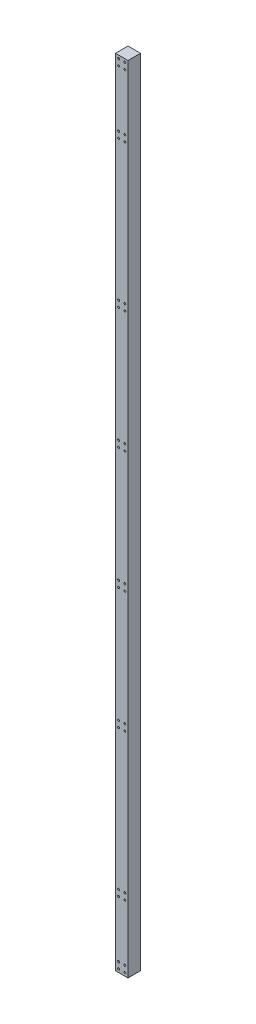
ISO-10303-21;
HEADER;
FILE_DESCRIPTION(('STEP AP214'),'2;1');
FILE_NAME('part.step','',(''),(''),'','','');
FILE_SCHEMA(('AUTOMOTIVE_DESIGN { 1 0 10303 214 1 1 1 1 }'));
ENDSEC;
DATA;
#1=APPLICATION_CONTEXT('core data for automotive mechanical design processes');
#2=APPLICATION_PROTOCOL_DEFINITION('international standard','automotive_design',2000,#1);
#3=PRODUCT_CONTEXT('',#1,'mechanical');
#4=PRODUCT('Part','Part','',(#3));
#5=PRODUCT_RELATED_PRODUCT_CATEGORY('part','',(#4));
#6=PRODUCT_DEFINITION_FORMATION('','',#4);
#7=PRODUCT_DEFINITION_CONTEXT('part definition',#1,'design');
#8=PRODUCT_DEFINITION('design','',#6,#7);
#9=PRODUCT_DEFINITION_SHAPE('','',#8);
#10=(LENGTH_UNIT() NAMED_UNIT(*) SI_UNIT(.MILLI.,.METRE.));
#11=(NAMED_UNIT(*) PLANE_ANGLE_UNIT() SI_UNIT($,.RADIAN.));
#12=(NAMED_UNIT(*) SI_UNIT($,.STERADIAN.) SOLID_ANGLE_UNIT());
#13=UNCERTAINTY_MEASURE_WITH_UNIT(LENGTH_MEASURE(1.E-05),#10,'distance_accuracy_value','');
#14=(GEOMETRIC_REPRESENTATION_CONTEXT(3) GLOBAL_UNCERTAINTY_ASSIGNED_CONTEXT((#13)) GLOBAL_UNIT_ASSIGNED_CONTEXT((#10,
#11,#12)) REPRESENTATION_CONTEXT('',''));
#15=CARTESIAN_POINT('',(0.,0.,0.));
#16=DIRECTION('',(0.,0.,1.));
#17=DIRECTION('',(1.,0.,0.));
#18=AXIS2_PLACEMENT_3D('',#15,#16,#17);
#19=CARTESIAN_POINT('',(-30.,3800.,-30.));
#20=DIRECTION('',(0.,0.,1.));
#21=DIRECTION('',(1.,0.,0.));
#22=AXIS2_PLACEMENT_3D('',#19,#20,#21);
#23=PLANE('',#22);
#24=CARTESIAN_POINT('',(-15.,1015.,-30.));
#25=DIRECTION('',(0.,0.,-1.));
#26=DIRECTION('',(-1.,0.,0.));
#27=AXIS2_PLACEMENT_3D('',#24,#25,#26);
#28=CIRCLE('',#27,7.5);
#29=CARTESIAN_POINT('',(-22.5,1015.,-30.));
#30=VERTEX_POINT('',#29);
#31=EDGE_CURVE('E642',#30,#30,#28,.T.);
#32=ORIENTED_EDGE('',*,*,#31,.F.);
#33=EDGE_LOOP('',(#32));
#34=FACE_BOUND('',#33,.T.);
#35=CARTESIAN_POINT('',(15.,1015.,-30.));
#36=DIRECTION('',(0.,0.,-1.));
#37=DIRECTION('',(-1.,0.,0.));
#38=AXIS2_PLACEMENT_3D('',#35,#36,#37);
#39=CIRCLE('',#38,7.5);
#40=CARTESIAN_POINT('',(7.5,1015.,-30.));
#41=VERTEX_POINT('',#40);
#42=EDGE_CURVE('E626',#41,#41,#39,.T.);
#43=ORIENTED_EDGE('',*,*,#42,.F.);
#44=EDGE_LOOP('',(#43));
#45=FACE_BOUND('',#44,.T.);
#46=CARTESIAN_POINT('',(15.0000000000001,1045.,-30.));
#47=DIRECTION('',(0.,0.,-1.));
#48=DIRECTION('',(-1.,0.,0.));
#49=AXIS2_PLACEMENT_3D('',#46,#47,#48);
#50=CIRCLE('',#49,7.5);
#51=CARTESIAN_POINT('',(7.50000000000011,1045.,-30.));
#52=VERTEX_POINT('',#51);
#53=EDGE_CURVE('E610',#52,#52,#50,.T.);
#54=ORIENTED_EDGE('',*,*,#53,.F.);
#55=EDGE_LOOP('',(#54));
#56=FACE_BOUND('',#55,.T.);
#57=CARTESIAN_POINT('',(-14.9999999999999,1045.,-30.));
#58=DIRECTION('',(0.,0.,-1.));
#59=DIRECTION('',(-1.,0.,0.));
#60=AXIS2_PLACEMENT_3D('',#57,#58,#59);
#61=CIRCLE('',#60,7.5);
#62=CARTESIAN_POINT('',(-22.4999999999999,1045.,-30.));
#63=VERTEX_POINT('',#62);
#64=EDGE_CURVE('E594',#63,#63,#61,.T.);
#65=ORIENTED_EDGE('',*,*,#64,.F.);
#66=EDGE_LOOP('',(#65));
#67=FACE_BOUND('',#66,.T.);
#68=CARTESIAN_POINT('',(-14.9999999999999,1595.,-30.));
#69=DIRECTION('',(0.,0.,-1.));
#70=DIRECTION('',(-1.,0.,0.));
#71=AXIS2_PLACEMENT_3D('',#68,#69,#70);
#72=CIRCLE('',#71,7.5);
#73=CARTESIAN_POINT('',(-22.4999999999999,1595.,-30.));
#74=VERTEX_POINT('',#73);
#75=EDGE_CURVE('E578',#74,#74,#72,.T.);
#76=ORIENTED_EDGE('',*,*,#75,.F.);
#77=EDGE_LOOP('',(#76));
#78=FACE_BOUND('',#77,.T.);
#79=CARTESIAN_POINT('',(15.0000000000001,1595.,-30.));
#80=DIRECTION('',(0.,0.,-1.));
#81=DIRECTION('',(-1.,0.,0.));
#82=AXIS2_PLACEMENT_3D('',#79,#80,#81);
#83=CIRCLE('',#82,7.49999999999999);
#84=CARTESIAN_POINT('',(7.50000000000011,1595.,-30.));
#85=VERTEX_POINT('',#84);
#86=EDGE_CURVE('E562',#85,#85,#83,.T.);
#87=ORIENTED_EDGE('',*,*,#86,.F.);
#88=EDGE_LOOP('',(#87));
#89=FACE_BOUND('',#88,.T.);
#90=CARTESIAN_POINT('',(15.0000000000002,1625.,-30.));
#91=DIRECTION('',(0.,0.,-1.));
#92=DIRECTION('',(-1.,0.,0.));
#93=AXIS2_PLACEMENT_3D('',#90,#91,#92);
#94=CIRCLE('',#93,7.49999999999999);
#95=CARTESIAN_POINT('',(7.50000000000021,1625.,-30.));
#96=VERTEX_POINT('',#95);
#97=EDGE_CURVE('E546',#96,#96,#94,.T.);
#98=ORIENTED_EDGE('',*,*,#97,.F.);
#99=EDGE_LOOP('',(#98));
#100=FACE_BOUND('',#99,.T.);
#101=CARTESIAN_POINT('',(-14.9999999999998,1625.,-30.));
#102=DIRECTION('',(0.,0.,-1.));
#103=DIRECTION('',(-1.,0.,0.));
#104=AXIS2_PLACEMENT_3D('',#101,#102,#103);
#105=CIRCLE('',#104,7.5);
#106=CARTESIAN_POINT('',(-22.4999999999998,1625.,-30.));
#107=VERTEX_POINT('',#106);
#108=EDGE_CURVE('E530',#107,#107,#105,.T.);
#109=ORIENTED_EDGE('',*,*,#108,.F.);
#110=EDGE_LOOP('',(#109));
#111=FACE_BOUND('',#110,.T.);
#112=CARTESIAN_POINT('',(-14.9999999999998,2175.,-30.));
#113=DIRECTION('',(0.,0.,-1.));
#114=DIRECTION('',(-1.,0.,0.));
#115=AXIS2_PLACEMENT_3D('',#112,#113,#114);
#116=CIRCLE('',#115,7.5);
#117=CARTESIAN_POINT('',(-22.4999999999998,2175.,-30.));
#118=VERTEX_POINT('',#117);
#119=EDGE_CURVE('E514',#118,#118,#116,.T.);
#120=ORIENTED_EDGE('',*,*,#119,.F.);
#121=EDGE_LOOP('',(#120));
#122=FACE_BOUND('',#121,.T.);
#123=CARTESIAN_POINT('',(15.0000000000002,2175.,-30.));
#124=DIRECTION('',(0.,0.,-1.));
#125=DIRECTION('',(-1.,0.,0.));
#126=AXIS2_PLACEMENT_3D('',#123,#124,#125);
#127=CIRCLE('',#126,7.5);
#128=CARTESIAN_POINT('',(7.50000000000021,2175.,-30.));
#129=VERTEX_POINT('',#128);
#130=EDGE_CURVE('E498',#129,#129,#127,.T.);
#131=ORIENTED_EDGE('',*,*,#130,.F.);
#132=EDGE_LOOP('',(#131));
#133=FACE_BOUND('',#132,.T.);
#134=CARTESIAN_POINT('',(15.0000000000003,2205.,-30.));
#135=DIRECTION('',(0.,0.,-1.));
#136=DIRECTION('',(-1.,0.,0.));
#137=AXIS2_PLACEMENT_3D('',#134,#135,#136);
#138=CIRCLE('',#137,7.5);
#139=CARTESIAN_POINT('',(7.50000000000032,2205.,-30.));
#140=VERTEX_POINT('',#139);
#141=EDGE_CURVE('E482',#140,#140,#138,.T.);
#142=ORIENTED_EDGE('',*,*,#141,.F.);
#143=EDGE_LOOP('',(#142));
#144=FACE_BOUND('',#143,.T.);
#145=CARTESIAN_POINT('',(-14.9999999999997,2205.,-30.));
#146=DIRECTION('',(0.,0.,-1.));
#147=DIRECTION('',(-1.,0.,0.));
#148=AXIS2_PLACEMENT_3D('',#145,#146,#147);
#149=CIRCLE('',#148,7.5);
#150=CARTESIAN_POINT('',(-22.4999999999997,2205.,-30.));
#151=VERTEX_POINT('',#150);
#152=EDGE_CURVE('E466',#151,#151,#149,.T.);
#153=ORIENTED_EDGE('',*,*,#152,.F.);
#154=EDGE_LOOP('',(#153));
#155=FACE_BOUND('',#154,.T.);
#156=CARTESIAN_POINT('',(-14.9999999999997,2755.,-30.));
#157=DIRECTION('',(0.,0.,-1.));
#158=DIRECTION('',(-1.,0.,0.));
#159=AXIS2_PLACEMENT_3D('',#156,#157,#158);
#160=CIRCLE('',#159,7.5);
#161=CARTESIAN_POINT('',(-22.4999999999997,2755.,-30.));
#162=VERTEX_POINT('',#161);
#163=EDGE_CURVE('E450',#162,#162,#160,.T.);
#164=ORIENTED_EDGE('',*,*,#163,.F.);
#165=EDGE_LOOP('',(#164));
#166=FACE_BOUND('',#165,.T.);
#167=CARTESIAN_POINT('',(15.0000000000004,2785.,-30.));
#168=DIRECTION('',(0.,0.,-1.));
#169=DIRECTION('',(-1.,0.,0.));
#170=AXIS2_PLACEMENT_3D('',#167,#168,#169);
#171=CIRCLE('',#170,7.5);
#172=CARTESIAN_POINT('',(7.50000000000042,2785.,-30.));
#173=VERTEX_POINT('',#172);
#174=EDGE_CURVE('E418',#173,#173,#171,.T.);
#175=ORIENTED_EDGE('',*,*,#174,.F.);
#176=EDGE_LOOP('',(#175));
#177=FACE_BOUND('',#176,.T.);
#178=CARTESIAN_POINT('',(-14.9999999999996,2785.,-30.));
#179=DIRECTION('',(0.,0.,-1.));
#180=DIRECTION('',(-1.,0.,0.));
#181=AXIS2_PLACEMENT_3D('',#178,#179,#180);
#182=CIRCLE('',#181,7.5);
#183=CARTESIAN_POINT('',(-22.4999999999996,2785.,-30.));
#184=VERTEX_POINT('',#183);
#185=EDGE_CURVE('E402',#184,#184,#182,.T.);
#186=ORIENTED_EDGE('',*,*,#185,.F.);
#187=EDGE_LOOP('',(#186));
#188=FACE_BOUND('',#187,.T.);
#189=CARTESIAN_POINT('',(15.,15.,-30.));
#190=DIRECTION('',(0.,0.,-1.));
#191=DIRECTION('',(-1.,0.,0.));
#192=AXIS2_PLACEMENT_3D('',#189,#190,#191);
#193=CIRCLE('',#192,7.5);
#194=CARTESIAN_POINT('',(7.5,15.,-30.));
#195=VERTEX_POINT('',#194);
#196=EDGE_CURVE('E386',#195,#195,#193,.T.);
#197=ORIENTED_EDGE('',*,*,#196,.F.);
#198=EDGE_LOOP('',(#197));
#199=FACE_BOUND('',#198,.T.);
#200=CARTESIAN_POINT('',(15.,45.,-30.));
#201=DIRECTION('',(0.,0.,-1.));
#202=DIRECTION('',(-1.,0.,0.));
#203=AXIS2_PLACEMENT_3D('',#200,#201,#202);
#204=CIRCLE('',#203,7.5);
#205=CARTESIAN_POINT('',(7.5,45.,-30.));
#206=VERTEX_POINT('',#205);
#207=EDGE_CURVE('E370',#206,#206,#204,.T.);
#208=ORIENTED_EDGE('',*,*,#207,.F.);
#209=EDGE_LOOP('',(#208));
#210=FACE_BOUND('',#209,.T.);
#211=CARTESIAN_POINT('',(-15.,45.,-30.));
#212=DIRECTION('',(0.,0.,-1.));
#213=DIRECTION('',(-1.,0.,0.));
#214=AXIS2_PLACEMENT_3D('',#211,#212,#213);
#215=CIRCLE('',#214,7.5);
#216=CARTESIAN_POINT('',(-22.5,45.,-30.));
#217=VERTEX_POINT('',#216);
#218=EDGE_CURVE('E354',#217,#217,#215,.T.);
#219=ORIENTED_EDGE('',*,*,#218,.F.);
#220=EDGE_LOOP('',(#219));
#221=FACE_BOUND('',#220,.T.);
#222=CARTESIAN_POINT('',(-15.,15.,-30.));
#223=DIRECTION('',(0.,0.,-1.));
#224=DIRECTION('',(-1.,0.,0.));
#225=AXIS2_PLACEMENT_3D('',#222,#223,#224);
#226=CIRCLE('',#225,7.5);
#227=CARTESIAN_POINT('',(-22.5,15.,-30.));
#228=VERTEX_POINT('',#227);
#229=EDGE_CURVE('E338',#228,#228,#226,.T.);
#230=ORIENTED_EDGE('',*,*,#229,.F.);
#231=EDGE_LOOP('',(#230));
#232=FACE_BOUND('',#231,.T.);
#233=CARTESIAN_POINT('',(15.,315.,-30.));
#234=DIRECTION('',(0.,0.,-1.));
#235=DIRECTION('',(-1.,0.,0.));
#236=AXIS2_PLACEMENT_3D('',#233,#234,#235);
#237=CIRCLE('',#236,7.5);
#238=CARTESIAN_POINT('',(7.5,315.,-30.));
#239=VERTEX_POINT('',#238);
#240=EDGE_CURVE('E322',#239,#239,#237,.T.);
#241=ORIENTED_EDGE('',*,*,#240,.F.);
#242=EDGE_LOOP('',(#241));
#243=FACE_BOUND('',#242,.T.);
#244=CARTESIAN_POINT('',(-15.,315.,-30.));
#245=DIRECTION('',(0.,0.,-1.));
#246=DIRECTION('',(-1.,0.,0.));
#247=AXIS2_PLACEMENT_3D('',#244,#245,#246);
#248=CIRCLE('',#247,7.5);
#249=CARTESIAN_POINT('',(-22.5,315.,-30.));
#250=VERTEX_POINT('',#249);
#251=EDGE_CURVE('E306',#250,#250,#248,.T.);
#252=ORIENTED_EDGE('',*,*,#251,.F.);
#253=EDGE_LOOP('',(#252));
#254=FACE_BOUND('',#253,.T.);
#255=CARTESIAN_POINT('',(15.,345.,-30.));
#256=DIRECTION('',(0.,0.,-1.));
#257=DIRECTION('',(-1.,0.,0.));
#258=AXIS2_PLACEMENT_3D('',#255,#256,#257);
#259=CIRCLE('',#258,7.5);
#260=CARTESIAN_POINT('',(7.5,345.,-30.));
#261=VERTEX_POINT('',#260);
#262=EDGE_CURVE('E290',#261,#261,#259,.T.);
#263=ORIENTED_EDGE('',*,*,#262,.F.);
#264=EDGE_LOOP('',(#263));
#265=FACE_BOUND('',#264,.T.);
#266=CARTESIAN_POINT('',(15.,3785.,-30.));
#267=DIRECTION('',(0.,0.,-1.));
#268=DIRECTION('',(-1.,0.,0.));
#269=AXIS2_PLACEMENT_3D('',#266,#267,#268);
#270=CIRCLE('',#269,7.5);
#271=CARTESIAN_POINT('',(7.50000000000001,3785.,-30.));
#272=VERTEX_POINT('',#271);
#273=EDGE_CURVE('E258',#272,#272,#270,.T.);
#274=ORIENTED_EDGE('',*,*,#273,.F.);
#275=EDGE_LOOP('',(#274));
#276=FACE_BOUND('',#275,.T.);
#277=CARTESIAN_POINT('',(-14.9999999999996,3785.,-30.));
#278=DIRECTION('',(0.,0.,-1.));
#279=DIRECTION('',(-1.,0.,0.));
#280=AXIS2_PLACEMENT_3D('',#277,#278,#279);
#281=CIRCLE('',#280,7.5);
#282=CARTESIAN_POINT('',(-22.4999999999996,3785.,-30.));
#283=VERTEX_POINT('',#282);
#284=EDGE_CURVE('E242',#283,#283,#281,.T.);
#285=ORIENTED_EDGE('',*,*,#284,.F.);
#286=EDGE_LOOP('',(#285));
#287=FACE_BOUND('',#286,.T.);
#288=CARTESIAN_POINT('',(-14.9999999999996,3755.,-30.));
#289=DIRECTION('',(0.,0.,-1.));
#290=DIRECTION('',(-1.,0.,0.));
#291=AXIS2_PLACEMENT_3D('',#288,#289,#290);
#292=CIRCLE('',#291,7.5);
#293=CARTESIAN_POINT('',(-22.4999999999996,3755.,-30.));
#294=VERTEX_POINT('',#293);
#295=EDGE_CURVE('E226',#294,#294,#292,.T.);
#296=ORIENTED_EDGE('',*,*,#295,.F.);
#297=EDGE_LOOP('',(#296));
#298=FACE_BOUND('',#297,.T.);
#299=CARTESIAN_POINT('',(15.,3755.,-30.));
#300=DIRECTION('',(0.,0.,-1.));
#301=DIRECTION('',(-1.,0.,0.));
#302=AXIS2_PLACEMENT_3D('',#299,#300,#301);
#303=CIRCLE('',#302,7.5);
#304=CARTESIAN_POINT('',(7.50000000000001,3755.,-30.));
#305=VERTEX_POINT('',#304);
#306=EDGE_CURVE('E210',#305,#305,#303,.T.);
#307=ORIENTED_EDGE('',*,*,#306,.F.);
#308=EDGE_LOOP('',(#307));
#309=FACE_BOUND('',#308,.T.);
#310=CARTESIAN_POINT('',(15.,3485.,-30.));
#311=DIRECTION('',(0.,0.,-1.));
#312=DIRECTION('',(-1.,0.,0.));
#313=AXIS2_PLACEMENT_3D('',#310,#311,#312);
#314=CIRCLE('',#313,7.5);
#315=CARTESIAN_POINT('',(7.50000000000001,3485.,-30.));
#316=VERTEX_POINT('',#315);
#317=EDGE_CURVE('E194',#316,#316,#314,.T.);
#318=ORIENTED_EDGE('',*,*,#317,.F.);
#319=EDGE_LOOP('',(#318));
#320=FACE_BOUND('',#319,.T.);
#321=CARTESIAN_POINT('',(-14.9999999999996,3485.,-30.));
#322=DIRECTION('',(0.,0.,-1.));
#323=DIRECTION('',(-1.,0.,0.));
#324=AXIS2_PLACEMENT_3D('',#321,#322,#323);
#325=CIRCLE('',#324,7.5);
#326=CARTESIAN_POINT('',(-22.4999999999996,3485.,-30.));
#327=VERTEX_POINT('',#326);
#328=EDGE_CURVE('E178',#327,#327,#325,.T.);
#329=ORIENTED_EDGE('',*,*,#328,.F.);
#330=EDGE_LOOP('',(#329));
#331=FACE_BOUND('',#330,.T.);
#332=CARTESIAN_POINT('',(15.,3455.,-30.));
#333=DIRECTION('',(0.,0.,-1.));
#334=DIRECTION('',(-1.,0.,0.));
#335=AXIS2_PLACEMENT_3D('',#332,#333,#334);
#336=CIRCLE('',#335,7.5);
#337=CARTESIAN_POINT('',(7.50000000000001,3455.,-30.));
#338=VERTEX_POINT('',#337);
#339=EDGE_CURVE('E162',#338,#338,#336,.T.);
#340=ORIENTED_EDGE('',*,*,#339,.F.);
#341=EDGE_LOOP('',(#340));
#342=FACE_BOUND('',#341,.T.);
#343=CARTESIAN_POINT('',(-14.9999999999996,3455.,-30.));
#344=DIRECTION('',(0.,0.,-1.));
#345=DIRECTION('',(-1.,0.,0.));
#346=AXIS2_PLACEMENT_3D('',#343,#344,#345);
#347=CIRCLE('',#346,7.5);
#348=CARTESIAN_POINT('',(-22.4999999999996,3455.,-30.));
#349=VERTEX_POINT('',#348);
#350=EDGE_CURVE('E146',#349,#349,#347,.T.);
#351=ORIENTED_EDGE('',*,*,#350,.F.);
#352=EDGE_LOOP('',(#351));
#353=FACE_BOUND('',#352,.T.);
#354=DIRECTION('',(-1.,0.,0.));
#355=VECTOR('',#354,1.);
#356=CARTESIAN_POINT('',(-30.,0.,-30.));
#357=LINE('',#356,#355);
#358=CARTESIAN_POINT('',(30.,0.,-30.));
#359=VERTEX_POINT('',#358);
#360=CARTESIAN_POINT('',(-30.,0.,-30.));
#361=VERTEX_POINT('',#360);
#362=EDGE_CURVE('E103',#359,#361,#357,.T.);
#363=ORIENTED_EDGE('',*,*,#362,.T.);
#364=DIRECTION('',(0.,-1.,0.));
#365=VECTOR('',#364,1.);
#366=CARTESIAN_POINT('',(-30.,3800.,-30.));
#367=LINE('',#366,#365);
#368=CARTESIAN_POINT('',(-30.,3800.,-30.));
#369=VERTEX_POINT('',#368);
#370=EDGE_CURVE('E55',#369,#361,#367,.T.);
#371=ORIENTED_EDGE('',*,*,#370,.F.);
#372=DIRECTION('',(-1.,0.,0.));
#373=VECTOR('',#372,1.);
#374=CARTESIAN_POINT('',(-30.,3800.,-30.));
#375=LINE('',#374,#373);
#376=CARTESIAN_POINT('',(30.,3800.,-30.));
#377=VERTEX_POINT('',#376);
#378=EDGE_CURVE('E93',#377,#369,#375,.T.);
#379=ORIENTED_EDGE('',*,*,#378,.F.);
#380=DIRECTION('',(0.,-1.,0.));
#381=VECTOR('',#380,1.);
#382=CARTESIAN_POINT('',(30.,3800.,-30.));
#383=LINE('',#382,#381);
#384=EDGE_CURVE('E11',#377,#359,#383,.T.);
#385=ORIENTED_EDGE('',*,*,#384,.T.);
#386=EDGE_LOOP('',(#363,#371,#379,#385));
#387=FACE_BOUND('',#386,.T.);
#388=CARTESIAN_POINT('',(-15.,345.,-30.));
#389=DIRECTION('',(0.,0.,-1.));
#390=DIRECTION('',(-1.,0.,0.));
#391=AXIS2_PLACEMENT_3D('',#388,#389,#390);
#392=CIRCLE('',#391,7.5);
#393=CARTESIAN_POINT('',(-22.5,345.,-30.));
#394=VERTEX_POINT('',#393);
#395=EDGE_CURVE('E274',#394,#394,#392,.T.);
#396=ORIENTED_EDGE('',*,*,#395,.F.);
#397=EDGE_LOOP('',(#396));
#398=FACE_BOUND('',#397,.T.);
#399=CARTESIAN_POINT('',(15.0000000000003,2755.,-30.));
#400=DIRECTION('',(0.,0.,-1.));
#401=DIRECTION('',(-1.,0.,0.));
#402=AXIS2_PLACEMENT_3D('',#399,#400,#401);
#403=CIRCLE('',#402,7.5);
#404=CARTESIAN_POINT('',(7.50000000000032,2755.,-30.));
#405=VERTEX_POINT('',#404);
#406=EDGE_CURVE('E434',#405,#405,#403,.T.);
#407=ORIENTED_EDGE('',*,*,#406,.F.);
#408=EDGE_LOOP('',(#407));
#409=FACE_BOUND('',#408,.T.);
#410=ADVANCED_FACE('F45',(#34,#45,#56,#67,#78,#89,#100,#111,#122,#133,#144,#155,#166,#177,#188,
#199,#210,#221,#232,#243,#254,#265,#276,#287,#298,#309,#320,#331,#342,#353,#387,#398,#409),#23,.F.);
#411=CARTESIAN_POINT('',(30.,3800.,-30.));
#412=DIRECTION('',(-1.,0.,0.));
#413=DIRECTION('',(0.,0.,1.));
#414=AXIS2_PLACEMENT_3D('',#411,#412,#413);
#415=PLANE('',#414);
#416=DIRECTION('',(0.,0.,-1.));
#417=VECTOR('',#416,1.);
#418=CARTESIAN_POINT('',(30.,0.,-30.));
#419=LINE('',#418,#417);
#420=CARTESIAN_POINT('',(30.,0.,30.));
#421=VERTEX_POINT('',#420);
#422=EDGE_CURVE('E114',#421,#359,#419,.T.);
#423=ORIENTED_EDGE('',*,*,#422,.T.);
#424=ORIENTED_EDGE('',*,*,#384,.F.);
#425=DIRECTION('',(0.,0.,-1.));
#426=VECTOR('',#425,1.);
#427=CARTESIAN_POINT('',(30.,3800.,-30.));
#428=LINE('',#427,#426);
#429=CARTESIAN_POINT('',(30.,3800.,30.));
#430=VERTEX_POINT('',#429);
#431=EDGE_CURVE('E98',#430,#377,#428,.T.);
#432=ORIENTED_EDGE('',*,*,#431,.F.);
#433=DIRECTION('',(0.,-1.,0.));
#434=VECTOR('',#433,1.);
#435=CARTESIAN_POINT('',(30.,3800.,30.));
#436=LINE('',#435,#434);
#437=EDGE_CURVE('E110',#430,#421,#436,.T.);
#438=ORIENTED_EDGE('',*,*,#437,.T.);
#439=EDGE_LOOP('',(#423,#424,#432,#438));
#440=FACE_BOUND('',#439,.T.);
#441=ADVANCED_FACE('F47',(#440),#415,.F.);
#442=CARTESIAN_POINT('',(-30.,3800.,-30.));
#443=DIRECTION('',(1.,0.,0.));
#444=DIRECTION('',(0.,0.,-1.));
#445=AXIS2_PLACEMENT_3D('',#442,#443,#444);
#446=PLANE('',#445);
#447=DIRECTION('',(0.,0.,1.));
#448=VECTOR('',#447,1.);
#449=CARTESIAN_POINT('',(-30.,0.,-30.));
#450=LINE('',#449,#448);
#451=CARTESIAN_POINT('',(-30.,0.,30.));
#452=VERTEX_POINT('',#451);
#453=EDGE_CURVE('E80',#361,#452,#450,.T.);
#454=ORIENTED_EDGE('',*,*,#453,.T.);
#455=DIRECTION('',(0.,-1.,0.));
#456=VECTOR('',#455,1.);
#457=CARTESIAN_POINT('',(-30.,3800.,30.));
#458=LINE('',#457,#456);
#459=CARTESIAN_POINT('',(-30.,3800.,30.));
#460=VERTEX_POINT('',#459);
#461=EDGE_CURVE('E105',#460,#452,#458,.T.);
#462=ORIENTED_EDGE('',*,*,#461,.F.);
#463=DIRECTION('',(0.,0.,1.));
#464=VECTOR('',#463,1.);
#465=CARTESIAN_POINT('',(-30.,3800.,-30.));
#466=LINE('',#465,#464);
#467=EDGE_CURVE('E96',#369,#460,#466,.T.);
#468=ORIENTED_EDGE('',*,*,#467,.F.);
#469=ORIENTED_EDGE('',*,*,#370,.T.);
#470=EDGE_LOOP('',(#454,#462,#468,#469));
#471=FACE_BOUND('',#470,.T.);
#472=ADVANCED_FACE('F106',(#471),#446,.F.);
#473=CARTESIAN_POINT('',(-30.,3800.,30.));
#474=DIRECTION('',(0.,0.,-1.));
#475=DIRECTION('',(-1.,0.,0.));
#476=AXIS2_PLACEMENT_3D('',#473,#474,#475);
#477=PLANE('',#476);
#478=CARTESIAN_POINT('',(-15.,1015.,30.));
#479=DIRECTION('',(0.,0.,-1.));
#480=DIRECTION('',(-1.,0.,0.));
#481=AXIS2_PLACEMENT_3D('',#478,#479,#480);
#482=CIRCLE('',#481,4.49999999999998);
#483=CARTESIAN_POINT('',(-19.5,1015.,30.));
#484=VERTEX_POINT('',#483);
#485=EDGE_CURVE('E630',#484,#484,#482,.T.);
#486=ORIENTED_EDGE('',*,*,#485,.T.);
#487=EDGE_LOOP('',(#486));
#488=FACE_BOUND('',#487,.T.);
#489=CARTESIAN_POINT('',(15.,1015.,30.));
#490=DIRECTION('',(0.,0.,-1.));
#491=DIRECTION('',(-1.,0.,0.));
#492=AXIS2_PLACEMENT_3D('',#489,#490,#491);
#493=CIRCLE('',#492,4.49999999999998);
#494=CARTESIAN_POINT('',(10.5,1015.,30.));
#495=VERTEX_POINT('',#494);
#496=EDGE_CURVE('E614',#495,#495,#493,.T.);
#497=ORIENTED_EDGE('',*,*,#496,.T.);
#498=EDGE_LOOP('',(#497));
#499=FACE_BOUND('',#498,.T.);
#500=CARTESIAN_POINT('',(15.0000000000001,1045.,30.));
#501=DIRECTION('',(0.,0.,-1.));
#502=DIRECTION('',(-1.,0.,0.));
#503=AXIS2_PLACEMENT_3D('',#500,#501,#502);
#504=CIRCLE('',#503,4.49999999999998);
#505=CARTESIAN_POINT('',(10.5000000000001,1045.,30.));
#506=VERTEX_POINT('',#505);
#507=EDGE_CURVE('E598',#506,#506,#504,.T.);
#508=ORIENTED_EDGE('',*,*,#507,.T.);
#509=EDGE_LOOP('',(#508));
#510=FACE_BOUND('',#509,.T.);
#511=CARTESIAN_POINT('',(-14.9999999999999,1045.,30.));
#512=DIRECTION('',(0.,0.,-1.));
#513=DIRECTION('',(-1.,0.,0.));
#514=AXIS2_PLACEMENT_3D('',#511,#512,#513);
#515=CIRCLE('',#514,4.49999999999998);
#516=CARTESIAN_POINT('',(-19.4999999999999,1045.,30.));
#517=VERTEX_POINT('',#516);
#518=EDGE_CURVE('E582',#517,#517,#515,.T.);
#519=ORIENTED_EDGE('',*,*,#518,.T.);
#520=EDGE_LOOP('',(#519));
#521=FACE_BOUND('',#520,.T.);
#522=CARTESIAN_POINT('',(-14.9999999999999,1595.,30.));
#523=DIRECTION('',(0.,0.,-1.));
#524=DIRECTION('',(-1.,0.,0.));
#525=AXIS2_PLACEMENT_3D('',#522,#523,#524);
#526=CIRCLE('',#525,4.49999999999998);
#527=CARTESIAN_POINT('',(-19.4999999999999,1595.,30.));
#528=VERTEX_POINT('',#527);
#529=EDGE_CURVE('E566',#528,#528,#526,.T.);
#530=ORIENTED_EDGE('',*,*,#529,.T.);
#531=EDGE_LOOP('',(#530));
#532=FACE_BOUND('',#531,.T.);
#533=CARTESIAN_POINT('',(15.0000000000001,1595.,30.));
#534=DIRECTION('',(0.,0.,-1.));
#535=DIRECTION('',(-1.,0.,0.));
#536=AXIS2_PLACEMENT_3D('',#533,#534,#535);
#537=CIRCLE('',#536,4.49999999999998);
#538=CARTESIAN_POINT('',(10.5000000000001,1595.,30.));
#539=VERTEX_POINT('',#538);
#540=EDGE_CURVE('E550',#539,#539,#537,.T.);
#541=ORIENTED_EDGE('',*,*,#540,.T.);
#542=EDGE_LOOP('',(#541));
#543=FACE_BOUND('',#542,.T.);
#544=CARTESIAN_POINT('',(15.0000000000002,1625.,30.));
#545=DIRECTION('',(0.,0.,-1.));
#546=DIRECTION('',(-1.,0.,0.));
#547=AXIS2_PLACEMENT_3D('',#544,#545,#546);
#548=CIRCLE('',#547,4.49999999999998);
#549=CARTESIAN_POINT('',(10.5000000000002,1625.,30.));
#550=VERTEX_POINT('',#549);
#551=EDGE_CURVE('E534',#550,#550,#548,.T.);
#552=ORIENTED_EDGE('',*,*,#551,.T.);
#553=EDGE_LOOP('',(#552));
#554=FACE_BOUND('',#553,.T.);
#555=CARTESIAN_POINT('',(-14.9999999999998,1625.,30.));
#556=DIRECTION('',(0.,0.,-1.));
#557=DIRECTION('',(-1.,0.,0.));
#558=AXIS2_PLACEMENT_3D('',#555,#556,#557);
#559=CIRCLE('',#558,4.49999999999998);
#560=CARTESIAN_POINT('',(-19.4999999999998,1625.,30.));
#561=VERTEX_POINT('',#560);
#562=EDGE_CURVE('E518',#561,#561,#559,.T.);
#563=ORIENTED_EDGE('',*,*,#562,.T.);
#564=EDGE_LOOP('',(#563));
#565=FACE_BOUND('',#564,.T.);
#566=CARTESIAN_POINT('',(-14.9999999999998,2175.,30.));
#567=DIRECTION('',(0.,0.,-1.));
#568=DIRECTION('',(-1.,0.,0.));
#569=AXIS2_PLACEMENT_3D('',#566,#567,#568);
#570=CIRCLE('',#569,4.49999999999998);
#571=CARTESIAN_POINT('',(-19.4999999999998,2175.,30.));
#572=VERTEX_POINT('',#571);
#573=EDGE_CURVE('E502',#572,#572,#570,.T.);
#574=ORIENTED_EDGE('',*,*,#573,.T.);
#575=EDGE_LOOP('',(#574));
#576=FACE_BOUND('',#575,.T.);
#577=CARTESIAN_POINT('',(15.0000000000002,2175.,30.));
#578=DIRECTION('',(0.,0.,-1.));
#579=DIRECTION('',(-1.,0.,0.));
#580=AXIS2_PLACEMENT_3D('',#577,#578,#579);
#581=CIRCLE('',#580,4.49999999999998);
#582=CARTESIAN_POINT('',(10.5000000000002,2175.,30.));
#583=VERTEX_POINT('',#582);
#584=EDGE_CURVE('E486',#583,#583,#581,.T.);
#585=ORIENTED_EDGE('',*,*,#584,.T.);
#586=EDGE_LOOP('',(#585));
#587=FACE_BOUND('',#586,.T.);
#588=CARTESIAN_POINT('',(15.0000000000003,2205.,30.));
#589=DIRECTION('',(0.,0.,-1.));
#590=DIRECTION('',(-1.,0.,0.));
#591=AXIS2_PLACEMENT_3D('',#588,#589,#590);
#592=CIRCLE('',#591,4.49999999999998);
#593=CARTESIAN_POINT('',(10.5000000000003,2205.,30.));
#594=VERTEX_POINT('',#593);
#595=EDGE_CURVE('E470',#594,#594,#592,.T.);
#596=ORIENTED_EDGE('',*,*,#595,.T.);
#597=EDGE_LOOP('',(#596));
#598=FACE_BOUND('',#597,.T.);
#599=CARTESIAN_POINT('',(-14.9999999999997,2205.,30.));
#600=DIRECTION('',(0.,0.,-1.));
#601=DIRECTION('',(-1.,0.,0.));
#602=AXIS2_PLACEMENT_3D('',#599,#600,#601);
#603=CIRCLE('',#602,4.49999999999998);
#604=CARTESIAN_POINT('',(-19.4999999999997,2205.,30.));
#605=VERTEX_POINT('',#604);
#606=EDGE_CURVE('E454',#605,#605,#603,.T.);
#607=ORIENTED_EDGE('',*,*,#606,.T.);
#608=EDGE_LOOP('',(#607));
#609=FACE_BOUND('',#608,.T.);
#610=CARTESIAN_POINT('',(-14.9999999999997,2755.,30.));
#611=DIRECTION('',(0.,0.,-1.));
#612=DIRECTION('',(-1.,0.,0.));
#613=AXIS2_PLACEMENT_3D('',#610,#611,#612);
#614=CIRCLE('',#613,4.49999999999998);
#615=CARTESIAN_POINT('',(-19.4999999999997,2755.,30.));
#616=VERTEX_POINT('',#615);
#617=EDGE_CURVE('E438',#616,#616,#614,.T.);
#618=ORIENTED_EDGE('',*,*,#617,.T.);
#619=EDGE_LOOP('',(#618));
#620=FACE_BOUND('',#619,.T.);
#621=CARTESIAN_POINT('',(15.0000000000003,2755.,30.));
#622=DIRECTION('',(0.,0.,-1.));
#623=DIRECTION('',(-1.,0.,0.));
#624=AXIS2_PLACEMENT_3D('',#621,#622,#623);
#625=CIRCLE('',#624,4.49999999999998);
#626=CARTESIAN_POINT('',(10.5000000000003,2755.,30.));
#627=VERTEX_POINT('',#626);
#628=EDGE_CURVE('E422',#627,#627,#625,.T.);
#629=ORIENTED_EDGE('',*,*,#628,.T.);
#630=EDGE_LOOP('',(#629));
#631=FACE_BOUND('',#630,.T.);
#632=CARTESIAN_POINT('',(15.0000000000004,2785.,30.));
#633=DIRECTION('',(0.,0.,-1.));
#634=DIRECTION('',(-1.,0.,0.));
#635=AXIS2_PLACEMENT_3D('',#632,#633,#634);
#636=CIRCLE('',#635,4.49999999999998);
#637=CARTESIAN_POINT('',(10.5000000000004,2785.,30.));
#638=VERTEX_POINT('',#637);
#639=EDGE_CURVE('E406',#638,#638,#636,.T.);
#640=ORIENTED_EDGE('',*,*,#639,.T.);
#641=EDGE_LOOP('',(#640));
#642=FACE_BOUND('',#641,.T.);
#643=CARTESIAN_POINT('',(-14.9999999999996,2785.,30.));
#644=DIRECTION('',(0.,0.,-1.));
#645=DIRECTION('',(-1.,0.,0.));
#646=AXIS2_PLACEMENT_3D('',#643,#644,#645);
#647=CIRCLE('',#646,4.49999999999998);
#648=CARTESIAN_POINT('',(-19.4999999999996,2785.,30.));
#649=VERTEX_POINT('',#648);
#650=EDGE_CURVE('E390',#649,#649,#647,.T.);
#651=ORIENTED_EDGE('',*,*,#650,.T.);
#652=EDGE_LOOP('',(#651));
#653=FACE_BOUND('',#652,.T.);
#654=CARTESIAN_POINT('',(15.,15.,30.));
#655=DIRECTION('',(0.,0.,-1.));
#656=DIRECTION('',(-1.,0.,0.));
#657=AXIS2_PLACEMENT_3D('',#654,#655,#656);
#658=CIRCLE('',#657,4.49999999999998);
#659=CARTESIAN_POINT('',(10.5,15.,30.));
#660=VERTEX_POINT('',#659);
#661=EDGE_CURVE('E374',#660,#660,#658,.T.);
#662=ORIENTED_EDGE('',*,*,#661,.T.);
#663=EDGE_LOOP('',(#662));
#664=FACE_BOUND('',#663,.T.);
#665=CARTESIAN_POINT('',(15.,45.,30.));
#666=DIRECTION('',(0.,0.,-1.));
#667=DIRECTION('',(-1.,0.,0.));
#668=AXIS2_PLACEMENT_3D('',#665,#666,#667);
#669=CIRCLE('',#668,4.49999999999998);
#670=CARTESIAN_POINT('',(10.5,45.,30.));
#671=VERTEX_POINT('',#670);
#672=EDGE_CURVE('E358',#671,#671,#669,.T.);
#673=ORIENTED_EDGE('',*,*,#672,.T.);
#674=EDGE_LOOP('',(#673));
#675=FACE_BOUND('',#674,.T.);
#676=CARTESIAN_POINT('',(-15.,45.,30.));
#677=DIRECTION('',(0.,0.,-1.));
#678=DIRECTION('',(-1.,0.,0.));
#679=AXIS2_PLACEMENT_3D('',#676,#677,#678);
#680=CIRCLE('',#679,4.49999999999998);
#681=CARTESIAN_POINT('',(-19.5,45.,30.));
#682=VERTEX_POINT('',#681);
#683=EDGE_CURVE('E342',#682,#682,#680,.T.);
#684=ORIENTED_EDGE('',*,*,#683,.T.);
#685=EDGE_LOOP('',(#684));
#686=FACE_BOUND('',#685,.T.);
#687=CARTESIAN_POINT('',(-15.,15.,30.));
#688=DIRECTION('',(0.,0.,-1.));
#689=DIRECTION('',(-1.,0.,0.));
#690=AXIS2_PLACEMENT_3D('',#687,#688,#689);
#691=CIRCLE('',#690,4.49999999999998);
#692=CARTESIAN_POINT('',(-19.5,15.,30.));
#693=VERTEX_POINT('',#692);
#694=EDGE_CURVE('E326',#693,#693,#691,.T.);
#695=ORIENTED_EDGE('',*,*,#694,.T.);
#696=EDGE_LOOP('',(#695));
#697=FACE_BOUND('',#696,.T.);
#698=CARTESIAN_POINT('',(15.,315.,30.));
#699=DIRECTION('',(0.,0.,-1.));
#700=DIRECTION('',(-1.,0.,0.));
#701=AXIS2_PLACEMENT_3D('',#698,#699,#700);
#702=CIRCLE('',#701,4.49999999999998);
#703=CARTESIAN_POINT('',(10.5,315.,30.));
#704=VERTEX_POINT('',#703);
#705=EDGE_CURVE('E310',#704,#704,#702,.T.);
#706=ORIENTED_EDGE('',*,*,#705,.T.);
#707=EDGE_LOOP('',(#706));
#708=FACE_BOUND('',#707,.T.);
#709=CARTESIAN_POINT('',(-15.,315.,30.));
#710=DIRECTION('',(0.,0.,-1.));
#711=DIRECTION('',(-1.,0.,0.));
#712=AXIS2_PLACEMENT_3D('',#709,#710,#711);
#713=CIRCLE('',#712,4.49999999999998);
#714=CARTESIAN_POINT('',(-19.5,315.,30.));
#715=VERTEX_POINT('',#714);
#716=EDGE_CURVE('E294',#715,#715,#713,.T.);
#717=ORIENTED_EDGE('',*,*,#716,.T.);
#718=EDGE_LOOP('',(#717));
#719=FACE_BOUND('',#718,.T.);
#720=CARTESIAN_POINT('',(15.,345.,30.));
#721=DIRECTION('',(0.,0.,-1.));
#722=DIRECTION('',(-1.,0.,0.));
#723=AXIS2_PLACEMENT_3D('',#720,#721,#722);
#724=CIRCLE('',#723,4.49999999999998);
#725=CARTESIAN_POINT('',(10.5,345.,30.));
#726=VERTEX_POINT('',#725);
#727=EDGE_CURVE('E278',#726,#726,#724,.T.);
#728=ORIENTED_EDGE('',*,*,#727,.T.);
#729=EDGE_LOOP('',(#728));
#730=FACE_BOUND('',#729,.T.);
#731=CARTESIAN_POINT('',(-15.,345.,30.));
#732=DIRECTION('',(0.,0.,-1.));
#733=DIRECTION('',(-1.,0.,0.));
#734=AXIS2_PLACEMENT_3D('',#731,#732,#733);
#735=CIRCLE('',#734,4.49999999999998);
#736=CARTESIAN_POINT('',(-19.5,345.,30.));
#737=VERTEX_POINT('',#736);
#738=EDGE_CURVE('E262',#737,#737,#735,.T.);
#739=ORIENTED_EDGE('',*,*,#738,.T.);
#740=EDGE_LOOP('',(#739));
#741=FACE_BOUND('',#740,.T.);
#742=CARTESIAN_POINT('',(15.,3785.,30.));
#743=DIRECTION('',(0.,0.,-1.));
#744=DIRECTION('',(-1.,0.,0.));
#745=AXIS2_PLACEMENT_3D('',#742,#743,#744);
#746=CIRCLE('',#745,4.49999999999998);
#747=CARTESIAN_POINT('',(10.5,3785.,30.));
#748=VERTEX_POINT('',#747);
#749=EDGE_CURVE('E246',#748,#748,#746,.T.);
#750=ORIENTED_EDGE('',*,*,#749,.T.);
#751=EDGE_LOOP('',(#750));
#752=FACE_BOUND('',#751,.T.);
#753=CARTESIAN_POINT('',(-14.9999999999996,3785.,30.));
#754=DIRECTION('',(0.,0.,-1.));
#755=DIRECTION('',(-1.,0.,0.));
#756=AXIS2_PLACEMENT_3D('',#753,#754,#755);
#757=CIRCLE('',#756,4.49999999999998);
#758=CARTESIAN_POINT('',(-19.4999999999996,3785.,30.));
#759=VERTEX_POINT('',#758);
#760=EDGE_CURVE('E230',#759,#759,#757,.T.);
#761=ORIENTED_EDGE('',*,*,#760,.T.);
#762=EDGE_LOOP('',(#761));
#763=FACE_BOUND('',#762,.T.);
#764=CARTESIAN_POINT('',(-14.9999999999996,3755.,30.));
#765=DIRECTION('',(0.,0.,-1.));
#766=DIRECTION('',(-1.,0.,0.));
#767=AXIS2_PLACEMENT_3D('',#764,#765,#766);
#768=CIRCLE('',#767,4.49999999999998);
#769=CARTESIAN_POINT('',(-19.4999999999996,3755.,30.));
#770=VERTEX_POINT('',#769);
#771=EDGE_CURVE('E214',#770,#770,#768,.T.);
#772=ORIENTED_EDGE('',*,*,#771,.T.);
#773=EDGE_LOOP('',(#772));
#774=FACE_BOUND('',#773,.T.);
#775=CARTESIAN_POINT('',(15.,3755.,30.));
#776=DIRECTION('',(0.,0.,-1.));
#777=DIRECTION('',(-1.,0.,0.));
#778=AXIS2_PLACEMENT_3D('',#775,#776,#777);
#779=CIRCLE('',#778,4.49999999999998);
#780=CARTESIAN_POINT('',(10.5,3755.,30.));
#781=VERTEX_POINT('',#780);
#782=EDGE_CURVE('E198',#781,#781,#779,.T.);
#783=ORIENTED_EDGE('',*,*,#782,.T.);
#784=EDGE_LOOP('',(#783));
#785=FACE_BOUND('',#784,.T.);
#786=CARTESIAN_POINT('',(15.,3485.,30.));
#787=DIRECTION('',(0.,0.,-1.));
#788=DIRECTION('',(-1.,0.,0.));
#789=AXIS2_PLACEMENT_3D('',#786,#787,#788);
#790=CIRCLE('',#789,4.49999999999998);
#791=CARTESIAN_POINT('',(10.5,3485.,30.));
#792=VERTEX_POINT('',#791);
#793=EDGE_CURVE('E182',#792,#792,#790,.T.);
#794=ORIENTED_EDGE('',*,*,#793,.T.);
#795=EDGE_LOOP('',(#794));
#796=FACE_BOUND('',#795,.T.);
#797=CARTESIAN_POINT('',(-14.9999999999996,3485.,30.));
#798=DIRECTION('',(0.,0.,-1.));
#799=DIRECTION('',(-1.,0.,0.));
#800=AXIS2_PLACEMENT_3D('',#797,#798,#799);
#801=CIRCLE('',#800,4.49999999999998);
#802=CARTESIAN_POINT('',(-19.4999999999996,3485.,30.));
#803=VERTEX_POINT('',#802);
#804=EDGE_CURVE('E166',#803,#803,#801,.T.);
#805=ORIENTED_EDGE('',*,*,#804,.T.);
#806=EDGE_LOOP('',(#805));
#807=FACE_BOUND('',#806,.T.);
#808=CARTESIAN_POINT('',(15.,3455.,30.));
#809=DIRECTION('',(0.,0.,-1.));
#810=DIRECTION('',(-1.,0.,0.));
#811=AXIS2_PLACEMENT_3D('',#808,#809,#810);
#812=CIRCLE('',#811,4.49999999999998);
#813=CARTESIAN_POINT('',(10.5,3455.,30.));
#814=VERTEX_POINT('',#813);
#815=EDGE_CURVE('E150',#814,#814,#812,.T.);
#816=ORIENTED_EDGE('',*,*,#815,.T.);
#817=EDGE_LOOP('',(#816));
#818=FACE_BOUND('',#817,.T.);
#819=CARTESIAN_POINT('',(-14.9999999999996,3455.,30.));
#820=DIRECTION('',(0.,0.,-1.));
#821=DIRECTION('',(-1.,0.,0.));
#822=AXIS2_PLACEMENT_3D('',#819,#820,#821);
#823=CIRCLE('',#822,4.49999999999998);
#824=CARTESIAN_POINT('',(-19.4999999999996,3455.,30.));
#825=VERTEX_POINT('',#824);
#826=EDGE_CURVE('E118',#825,#825,#823,.T.);
#827=ORIENTED_EDGE('',*,*,#826,.T.);
#828=EDGE_LOOP('',(#827));
#829=FACE_BOUND('',#828,.T.);
#830=DIRECTION('',(1.,0.,0.));
#831=VECTOR('',#830,1.);
#832=CARTESIAN_POINT('',(-30.,0.,30.));
#833=LINE('',#832,#831);
#834=EDGE_CURVE('E86',#452,#421,#833,.T.);
#835=ORIENTED_EDGE('',*,*,#834,.T.);
#836=ORIENTED_EDGE('',*,*,#437,.F.);
#837=DIRECTION('',(1.,0.,0.));
#838=VECTOR('',#837,1.);
#839=CARTESIAN_POINT('',(-30.,3800.,30.));
#840=LINE('',#839,#838);
#841=EDGE_CURVE('E63',#460,#430,#840,.T.);
#842=ORIENTED_EDGE('',*,*,#841,.F.);
#843=ORIENTED_EDGE('',*,*,#461,.T.);
#844=EDGE_LOOP('',(#835,#836,#842,#843));
#845=FACE_BOUND('',#844,.T.);
#846=ADVANCED_FACE('F128',(#488,#499,#510,#521,#532,#543,#554,#565,#576,#587,#598,#609,#620,
#631,#642,#653,#664,#675,#686,#697,#708,#719,#730,#741,#752,#763,#774,#785,#796,#807,#818,#829,
#845),#477,.F.);
#847=CARTESIAN_POINT('',(0.,3800.,0.));
#848=DIRECTION('',(0.,1.,0.));
#849=DIRECTION('',(0.,0.,1.));
#850=AXIS2_PLACEMENT_3D('',#847,#848,#849);
#851=PLANE('',#850);
#852=ORIENTED_EDGE('',*,*,#431,.T.);
#853=ORIENTED_EDGE('',*,*,#378,.T.);
#854=ORIENTED_EDGE('',*,*,#467,.T.);
#855=ORIENTED_EDGE('',*,*,#841,.T.);
#856=EDGE_LOOP('',(#852,#853,#854,#855));
#857=FACE_BOUND('',#856,.T.);
#858=ADVANCED_FACE('F94',(#857),#851,.T.);
#859=CARTESIAN_POINT('',(0.,0.,0.));
#860=DIRECTION('',(0.,1.,0.));
#861=DIRECTION('',(0.,0.,1.));
#862=AXIS2_PLACEMENT_3D('',#859,#860,#861);
#863=PLANE('',#862);
#864=ORIENTED_EDGE('',*,*,#422,.F.);
#865=ORIENTED_EDGE('',*,*,#834,.F.);
#866=ORIENTED_EDGE('',*,*,#453,.F.);
#867=ORIENTED_EDGE('',*,*,#362,.F.);
#868=EDGE_LOOP('',(#864,#865,#866,#867));
#869=FACE_BOUND('',#868,.T.);
#870=ADVANCED_FACE('F131',(#869),#863,.F.);
#871=CARTESIAN_POINT('',(-14.9999999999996,3455.,-30.));
#872=DIRECTION('',(0.,0.,-1.));
#873=DIRECTION('',(-1.,0.,0.));
#874=AXIS2_PLACEMENT_3D('',#871,#872,#873);
#875=CYLINDRICAL_SURFACE('',#874,4.5);
#876=ORIENTED_EDGE('',*,*,#826,.F.);
#877=EDGE_LOOP('',(#876));
#878=FACE_BOUND('',#877,.T.);
#879=CARTESIAN_POINT('',(-14.9999999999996,3455.,-24.));
#880=DIRECTION('',(0.,0.,-1.));
#881=DIRECTION('',(-1.,0.,0.));
#882=AXIS2_PLACEMENT_3D('',#879,#880,#881);
#883=CIRCLE('',#882,4.50000000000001);
#884=CARTESIAN_POINT('',(-19.4999999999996,3455.,-24.));
#885=VERTEX_POINT('',#884);
#886=EDGE_CURVE('E138',#885,#885,#883,.T.);
#887=ORIENTED_EDGE('',*,*,#886,.T.);
#888=EDGE_LOOP('',(#887));
#889=FACE_BOUND('',#888,.T.);
#890=ADVANCED_FACE('F722',(#878,#889),#875,.F.);
#891=CARTESIAN_POINT('',(-10.4999999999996,3455.,-24.));
#892=DIRECTION('',(0.,0.,1.));
#893=DIRECTION('',(1.,0.,0.));
#894=AXIS2_PLACEMENT_3D('',#891,#892,#893);
#895=PLANE('',#894);
#896=ORIENTED_EDGE('',*,*,#886,.F.);
#897=EDGE_LOOP('',(#896));
#898=FACE_BOUND('',#897,.T.);
#899=CARTESIAN_POINT('',(-14.9999999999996,3455.,-24.));
#900=DIRECTION('',(0.,0.,-1.));
#901=DIRECTION('',(-1.,0.,0.));
#902=AXIS2_PLACEMENT_3D('',#899,#900,#901);
#903=CIRCLE('',#902,7.5);
#904=CARTESIAN_POINT('',(-22.4999999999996,3455.,-24.));
#905=VERTEX_POINT('',#904);
#906=EDGE_CURVE('E142',#905,#905,#903,.T.);
#907=ORIENTED_EDGE('',*,*,#906,.T.);
#908=EDGE_LOOP('',(#907));
#909=FACE_BOUND('',#908,.T.);
#910=ADVANCED_FACE('F712',(#898,#909),#895,.F.);
#911=CARTESIAN_POINT('',(-14.9999999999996,3455.,-30.));
#912=DIRECTION('',(0.,0.,-1.));
#913=DIRECTION('',(-1.,0.,0.));
#914=AXIS2_PLACEMENT_3D('',#911,#912,#913);
#915=CYLINDRICAL_SURFACE('',#914,7.5);
#916=ORIENTED_EDGE('',*,*,#906,.F.);
#917=EDGE_LOOP('',(#916));
#918=FACE_BOUND('',#917,.T.);
#919=ORIENTED_EDGE('',*,*,#350,.T.);
#920=EDGE_LOOP('',(#919));
#921=FACE_BOUND('',#920,.T.);
#922=ADVANCED_FACE('F709',(#918,#921),#915,.F.);
#923=CARTESIAN_POINT('',(15.,3455.,-30.));
#924=DIRECTION('',(0.,0.,-1.));
#925=DIRECTION('',(-1.,0.,0.));
#926=AXIS2_PLACEMENT_3D('',#923,#924,#925);
#927=CYLINDRICAL_SURFACE('',#926,4.5);
#928=ORIENTED_EDGE('',*,*,#815,.F.);
#929=EDGE_LOOP('',(#928));
#930=FACE_BOUND('',#929,.T.);
#931=CARTESIAN_POINT('',(15.,3455.,-24.));
#932=DIRECTION('',(0.,0.,-1.));
#933=DIRECTION('',(-1.,0.,0.));
#934=AXIS2_PLACEMENT_3D('',#931,#932,#933);
#935=CIRCLE('',#934,4.50000000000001);
#936=CARTESIAN_POINT('',(10.5,3455.,-24.));
#937=VERTEX_POINT('',#936);
#938=EDGE_CURVE('E154',#937,#937,#935,.T.);
#939=ORIENTED_EDGE('',*,*,#938,.T.);
#940=EDGE_LOOP('',(#939));
#941=FACE_BOUND('',#940,.T.);
#942=ADVANCED_FACE('F711',(#930,#941),#927,.F.);
#943=CARTESIAN_POINT('',(19.5,3455.,-24.));
#944=DIRECTION('',(0.,0.,1.));
#945=DIRECTION('',(1.,0.,0.));
#946=AXIS2_PLACEMENT_3D('',#943,#944,#945);
#947=PLANE('',#946);
#948=ORIENTED_EDGE('',*,*,#938,.F.);
#949=EDGE_LOOP('',(#948));
#950=FACE_BOUND('',#949,.T.);
#951=CARTESIAN_POINT('',(15.,3455.,-24.));
#952=DIRECTION('',(0.,0.,-1.));
#953=DIRECTION('',(-1.,0.,0.));
#954=AXIS2_PLACEMENT_3D('',#951,#952,#953);
#955=CIRCLE('',#954,7.5);
#956=CARTESIAN_POINT('',(7.50000000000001,3455.,-24.));
#957=VERTEX_POINT('',#956);
#958=EDGE_CURVE('E158',#957,#957,#955,.T.);
#959=ORIENTED_EDGE('',*,*,#958,.T.);
#960=EDGE_LOOP('',(#959));
#961=FACE_BOUND('',#960,.T.);
#962=ADVANCED_FACE('F719',(#950,#961),#947,.F.);
#963=CARTESIAN_POINT('',(15.,3455.,-30.));
#964=DIRECTION('',(0.,0.,-1.));
#965=DIRECTION('',(-1.,0.,0.));
#966=AXIS2_PLACEMENT_3D('',#963,#964,#965);
#967=CYLINDRICAL_SURFACE('',#966,7.5);
#968=ORIENTED_EDGE('',*,*,#958,.F.);
#969=EDGE_LOOP('',(#968));
#970=FACE_BOUND('',#969,.T.);
#971=ORIENTED_EDGE('',*,*,#339,.T.);
#972=EDGE_LOOP('',(#971));
#973=FACE_BOUND('',#972,.T.);
#974=ADVANCED_FACE('F804',(#970,#973),#967,.F.);
#975=CARTESIAN_POINT('',(-14.9999999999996,3485.,-30.));
#976=DIRECTION('',(0.,0.,-1.));
#977=DIRECTION('',(-1.,0.,0.));
#978=AXIS2_PLACEMENT_3D('',#975,#976,#977);
#979=CYLINDRICAL_SURFACE('',#978,4.5);
#980=ORIENTED_EDGE('',*,*,#804,.F.);
#981=EDGE_LOOP('',(#980));
#982=FACE_BOUND('',#981,.T.);
#983=CARTESIAN_POINT('',(-14.9999999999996,3485.,-24.));
#984=DIRECTION('',(0.,0.,-1.));
#985=DIRECTION('',(-1.,0.,0.));
#986=AXIS2_PLACEMENT_3D('',#983,#984,#985);
#987=CIRCLE('',#986,4.50000000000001);
#988=CARTESIAN_POINT('',(-19.4999999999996,3485.,-24.));
#989=VERTEX_POINT('',#988);
#990=EDGE_CURVE('E170',#989,#989,#987,.T.);
#991=ORIENTED_EDGE('',*,*,#990,.T.);
#992=EDGE_LOOP('',(#991));
#993=FACE_BOUND('',#992,.T.);
#994=ADVANCED_FACE('F813',(#982,#993),#979,.F.);
#995=CARTESIAN_POINT('',(-10.4999999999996,3485.,-24.));
#996=DIRECTION('',(0.,0.,1.));
#997=DIRECTION('',(1.,0.,0.));
#998=AXIS2_PLACEMENT_3D('',#995,#996,#997);
#999=PLANE('',#998);
#1000=ORIENTED_EDGE('',*,*,#990,.F.);
#1001=EDGE_LOOP('',(#1000));
#1002=FACE_BOUND('',#1001,.T.);
#1003=CARTESIAN_POINT('',(-14.9999999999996,3485.,-24.));
#1004=DIRECTION('',(0.,0.,-1.));
#1005=DIRECTION('',(-1.,0.,0.));
#1006=AXIS2_PLACEMENT_3D('',#1003,#1004,#1005);
#1007=CIRCLE('',#1006,7.5);
#1008=CARTESIAN_POINT('',(-22.4999999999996,3485.,-24.));
#1009=VERTEX_POINT('',#1008);
#1010=EDGE_CURVE('E174',#1009,#1009,#1007,.T.);
#1011=ORIENTED_EDGE('',*,*,#1010,.T.);
#1012=EDGE_LOOP('',(#1011));
#1013=FACE_BOUND('',#1012,.T.);
#1014=ADVANCED_FACE('F823',(#1002,#1013),#999,.F.);
#1015=CARTESIAN_POINT('',(-14.9999999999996,3485.,-30.));
#1016=DIRECTION('',(0.,0.,-1.));
#1017=DIRECTION('',(-1.,0.,0.));
#1018=AXIS2_PLACEMENT_3D('',#1015,#1016,#1017);
#1019=CYLINDRICAL_SURFACE('',#1018,7.5);
#1020=ORIENTED_EDGE('',*,*,#1010,.F.);
#1021=EDGE_LOOP('',(#1020));
#1022=FACE_BOUND('',#1021,.T.);
#1023=ORIENTED_EDGE('',*,*,#328,.T.);
#1024=EDGE_LOOP('',(#1023));
#1025=FACE_BOUND('',#1024,.T.);
#1026=ADVANCED_FACE('F833',(#1022,#1025),#1019,.F.);
#1027=CARTESIAN_POINT('',(15.,3485.,-30.));
#1028=DIRECTION('',(0.,0.,-1.));
#1029=DIRECTION('',(-1.,0.,0.));
#1030=AXIS2_PLACEMENT_3D('',#1027,#1028,#1029);
#1031=CYLINDRICAL_SURFACE('',#1030,4.5);
#1032=ORIENTED_EDGE('',*,*,#793,.F.);
#1033=EDGE_LOOP('',(#1032));
#1034=FACE_BOUND('',#1033,.T.);
#1035=CARTESIAN_POINT('',(15.,3485.,-24.));
#1036=DIRECTION('',(0.,0.,-1.));
#1037=DIRECTION('',(-1.,0.,0.));
#1038=AXIS2_PLACEMENT_3D('',#1035,#1036,#1037);
#1039=CIRCLE('',#1038,4.50000000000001);
#1040=CARTESIAN_POINT('',(10.5,3485.,-24.));
#1041=VERTEX_POINT('',#1040);
#1042=EDGE_CURVE('E186',#1041,#1041,#1039,.T.);
#1043=ORIENTED_EDGE('',*,*,#1042,.T.);
#1044=EDGE_LOOP('',(#1043));
#1045=FACE_BOUND('',#1044,.T.);
#1046=ADVANCED_FACE('F843',(#1034,#1045),#1031,.F.);
#1047=CARTESIAN_POINT('',(19.5,3485.,-24.));
#1048=DIRECTION('',(0.,0.,1.));
#1049=DIRECTION('',(1.,0.,0.));
#1050=AXIS2_PLACEMENT_3D('',#1047,#1048,#1049);
#1051=PLANE('',#1050);
#1052=ORIENTED_EDGE('',*,*,#1042,.F.);
#1053=EDGE_LOOP('',(#1052));
#1054=FACE_BOUND('',#1053,.T.);
#1055=CARTESIAN_POINT('',(15.,3485.,-24.));
#1056=DIRECTION('',(0.,0.,-1.));
#1057=DIRECTION('',(-1.,0.,0.));
#1058=AXIS2_PLACEMENT_3D('',#1055,#1056,#1057);
#1059=CIRCLE('',#1058,7.5);
#1060=CARTESIAN_POINT('',(7.50000000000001,3485.,-24.));
#1061=VERTEX_POINT('',#1060);
#1062=EDGE_CURVE('E190',#1061,#1061,#1059,.T.);
#1063=ORIENTED_EDGE('',*,*,#1062,.T.);
#1064=EDGE_LOOP('',(#1063));
#1065=FACE_BOUND('',#1064,.T.);
#1066=ADVANCED_FACE('F853',(#1054,#1065),#1051,.F.);
#1067=CARTESIAN_POINT('',(15.,3485.,-30.));
#1068=DIRECTION('',(0.,0.,-1.));
#1069=DIRECTION('',(-1.,0.,0.));
#1070=AXIS2_PLACEMENT_3D('',#1067,#1068,#1069);
#1071=CYLINDRICAL_SURFACE('',#1070,7.5);
#1072=ORIENTED_EDGE('',*,*,#1062,.F.);
#1073=EDGE_LOOP('',(#1072));
#1074=FACE_BOUND('',#1073,.T.);
#1075=ORIENTED_EDGE('',*,*,#317,.T.);
#1076=EDGE_LOOP('',(#1075));
#1077=FACE_BOUND('',#1076,.T.);
#1078=ADVANCED_FACE('F863',(#1074,#1077),#1071,.F.);
#1079=CARTESIAN_POINT('',(15.,3755.,-30.));
#1080=DIRECTION('',(0.,0.,-1.));
#1081=DIRECTION('',(-1.,0.,0.));
#1082=AXIS2_PLACEMENT_3D('',#1079,#1080,#1081);
#1083=CYLINDRICAL_SURFACE('',#1082,4.5);
#1084=ORIENTED_EDGE('',*,*,#782,.F.);
#1085=EDGE_LOOP('',(#1084));
#1086=FACE_BOUND('',#1085,.T.);
#1087=CARTESIAN_POINT('',(15.,3755.,-24.));
#1088=DIRECTION('',(0.,0.,-1.));
#1089=DIRECTION('',(-1.,0.,0.));
#1090=AXIS2_PLACEMENT_3D('',#1087,#1088,#1089);
#1091=CIRCLE('',#1090,4.50000000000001);
#1092=CARTESIAN_POINT('',(10.5,3755.,-24.));
#1093=VERTEX_POINT('',#1092);
#1094=EDGE_CURVE('E202',#1093,#1093,#1091,.T.);
#1095=ORIENTED_EDGE('',*,*,#1094,.T.);
#1096=EDGE_LOOP('',(#1095));
#1097=FACE_BOUND('',#1096,.T.);
#1098=ADVANCED_FACE('F873',(#1086,#1097),#1083,.F.);
#1099=CARTESIAN_POINT('',(19.5,3755.,-24.));
#1100=DIRECTION('',(0.,0.,1.));
#1101=DIRECTION('',(1.,0.,0.));
#1102=AXIS2_PLACEMENT_3D('',#1099,#1100,#1101);
#1103=PLANE('',#1102);
#1104=ORIENTED_EDGE('',*,*,#1094,.F.);
#1105=EDGE_LOOP('',(#1104));
#1106=FACE_BOUND('',#1105,.T.);
#1107=CARTESIAN_POINT('',(15.,3755.,-24.));
#1108=DIRECTION('',(0.,0.,-1.));
#1109=DIRECTION('',(-1.,0.,0.));
#1110=AXIS2_PLACEMENT_3D('',#1107,#1108,#1109);
#1111=CIRCLE('',#1110,7.5);
#1112=CARTESIAN_POINT('',(7.50000000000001,3755.,-24.));
#1113=VERTEX_POINT('',#1112);
#1114=EDGE_CURVE('E206',#1113,#1113,#1111,.T.);
#1115=ORIENTED_EDGE('',*,*,#1114,.T.);
#1116=EDGE_LOOP('',(#1115));
#1117=FACE_BOUND('',#1116,.T.);
#1118=ADVANCED_FACE('F883',(#1106,#1117),#1103,.F.);
#1119=CARTESIAN_POINT('',(15.,3755.,-30.));
#1120=DIRECTION('',(0.,0.,-1.));
#1121=DIRECTION('',(-1.,0.,0.));
#1122=AXIS2_PLACEMENT_3D('',#1119,#1120,#1121);
#1123=CYLINDRICAL_SURFACE('',#1122,7.5);
#1124=ORIENTED_EDGE('',*,*,#1114,.F.);
#1125=EDGE_LOOP('',(#1124));
#1126=FACE_BOUND('',#1125,.T.);
#1127=ORIENTED_EDGE('',*,*,#306,.T.);
#1128=EDGE_LOOP('',(#1127));
#1129=FACE_BOUND('',#1128,.T.);
#1130=ADVANCED_FACE('F893',(#1126,#1129),#1123,.F.);
#1131=CARTESIAN_POINT('',(-14.9999999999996,3755.,-30.));
#1132=DIRECTION('',(0.,0.,-1.));
#1133=DIRECTION('',(-1.,0.,0.));
#1134=AXIS2_PLACEMENT_3D('',#1131,#1132,#1133);
#1135=CYLINDRICAL_SURFACE('',#1134,4.5);
#1136=ORIENTED_EDGE('',*,*,#771,.F.);
#1137=EDGE_LOOP('',(#1136));
#1138=FACE_BOUND('',#1137,.T.);
#1139=CARTESIAN_POINT('',(-14.9999999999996,3755.,-24.));
#1140=DIRECTION('',(0.,0.,-1.));
#1141=DIRECTION('',(-1.,0.,0.));
#1142=AXIS2_PLACEMENT_3D('',#1139,#1140,#1141);
#1143=CIRCLE('',#1142,4.50000000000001);
#1144=CARTESIAN_POINT('',(-19.4999999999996,3755.,-24.));
#1145=VERTEX_POINT('',#1144);
#1146=EDGE_CURVE('E218',#1145,#1145,#1143,.T.);
#1147=ORIENTED_EDGE('',*,*,#1146,.T.);
#1148=EDGE_LOOP('',(#1147));
#1149=FACE_BOUND('',#1148,.T.);
#1150=ADVANCED_FACE('F903',(#1138,#1149),#1135,.F.);
#1151=CARTESIAN_POINT('',(-10.4999999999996,3755.,-24.));
#1152=DIRECTION('',(0.,0.,1.));
#1153=DIRECTION('',(1.,0.,0.));
#1154=AXIS2_PLACEMENT_3D('',#1151,#1152,#1153);
#1155=PLANE('',#1154);
#1156=ORIENTED_EDGE('',*,*,#1146,.F.);
#1157=EDGE_LOOP('',(#1156));
#1158=FACE_BOUND('',#1157,.T.);
#1159=CARTESIAN_POINT('',(-14.9999999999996,3755.,-24.));
#1160=DIRECTION('',(0.,0.,-1.));
#1161=DIRECTION('',(-1.,0.,0.));
#1162=AXIS2_PLACEMENT_3D('',#1159,#1160,#1161);
#1163=CIRCLE('',#1162,7.5);
#1164=CARTESIAN_POINT('',(-22.4999999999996,3755.,-24.));
#1165=VERTEX_POINT('',#1164);
#1166=EDGE_CURVE('E222',#1165,#1165,#1163,.T.);
#1167=ORIENTED_EDGE('',*,*,#1166,.T.);
#1168=EDGE_LOOP('',(#1167));
#1169=FACE_BOUND('',#1168,.T.);
#1170=ADVANCED_FACE('F913',(#1158,#1169),#1155,.F.);
#1171=CARTESIAN_POINT('',(-14.9999999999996,3755.,-30.));
#1172=DIRECTION('',(0.,0.,-1.));
#1173=DIRECTION('',(-1.,0.,0.));
#1174=AXIS2_PLACEMENT_3D('',#1171,#1172,#1173);
#1175=CYLINDRICAL_SURFACE('',#1174,7.5);
#1176=ORIENTED_EDGE('',*,*,#1166,.F.);
#1177=EDGE_LOOP('',(#1176));
#1178=FACE_BOUND('',#1177,.T.);
#1179=ORIENTED_EDGE('',*,*,#295,.T.);
#1180=EDGE_LOOP('',(#1179));
#1181=FACE_BOUND('',#1180,.T.);
#1182=ADVANCED_FACE('F923',(#1178,#1181),#1175,.F.);
#1183=CARTESIAN_POINT('',(-14.9999999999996,3785.,-30.));
#1184=DIRECTION('',(0.,0.,-1.));
#1185=DIRECTION('',(-1.,0.,0.));
#1186=AXIS2_PLACEMENT_3D('',#1183,#1184,#1185);
#1187=CYLINDRICAL_SURFACE('',#1186,4.5);
#1188=ORIENTED_EDGE('',*,*,#760,.F.);
#1189=EDGE_LOOP('',(#1188));
#1190=FACE_BOUND('',#1189,.T.);
#1191=CARTESIAN_POINT('',(-14.9999999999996,3785.,-24.));
#1192=DIRECTION('',(0.,0.,-1.));
#1193=DIRECTION('',(-1.,0.,0.));
#1194=AXIS2_PLACEMENT_3D('',#1191,#1192,#1193);
#1195=CIRCLE('',#1194,4.50000000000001);
#1196=CARTESIAN_POINT('',(-19.4999999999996,3785.,-24.));
#1197=VERTEX_POINT('',#1196);
#1198=EDGE_CURVE('E234',#1197,#1197,#1195,.T.);
#1199=ORIENTED_EDGE('',*,*,#1198,.T.);
#1200=EDGE_LOOP('',(#1199));
#1201=FACE_BOUND('',#1200,.T.);
#1202=ADVANCED_FACE('F933',(#1190,#1201),#1187,.F.);
#1203=CARTESIAN_POINT('',(-10.4999999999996,3785.,-24.));
#1204=DIRECTION('',(0.,0.,1.));
#1205=DIRECTION('',(1.,0.,0.));
#1206=AXIS2_PLACEMENT_3D('',#1203,#1204,#1205);
#1207=PLANE('',#1206);
#1208=ORIENTED_EDGE('',*,*,#1198,.F.);
#1209=EDGE_LOOP('',(#1208));
#1210=FACE_BOUND('',#1209,.T.);
#1211=CARTESIAN_POINT('',(-14.9999999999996,3785.,-24.));
#1212=DIRECTION('',(0.,0.,-1.));
#1213=DIRECTION('',(-1.,0.,0.));
#1214=AXIS2_PLACEMENT_3D('',#1211,#1212,#1213);
#1215=CIRCLE('',#1214,7.5);
#1216=CARTESIAN_POINT('',(-22.4999999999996,3785.,-24.));
#1217=VERTEX_POINT('',#1216);
#1218=EDGE_CURVE('E238',#1217,#1217,#1215,.T.);
#1219=ORIENTED_EDGE('',*,*,#1218,.T.);
#1220=EDGE_LOOP('',(#1219));
#1221=FACE_BOUND('',#1220,.T.);
#1222=ADVANCED_FACE('F943',(#1210,#1221),#1207,.F.);
#1223=CARTESIAN_POINT('',(-14.9999999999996,3785.,-30.));
#1224=DIRECTION('',(0.,0.,-1.));
#1225=DIRECTION('',(-1.,0.,0.));
#1226=AXIS2_PLACEMENT_3D('',#1223,#1224,#1225);
#1227=CYLINDRICAL_SURFACE('',#1226,7.5);
#1228=ORIENTED_EDGE('',*,*,#1218,.F.);
#1229=EDGE_LOOP('',(#1228));
#1230=FACE_BOUND('',#1229,.T.);
#1231=ORIENTED_EDGE('',*,*,#284,.T.);
#1232=EDGE_LOOP('',(#1231));
#1233=FACE_BOUND('',#1232,.T.);
#1234=ADVANCED_FACE('F953',(#1230,#1233),#1227,.F.);
#1235=CARTESIAN_POINT('',(15.,3785.,-30.));
#1236=DIRECTION('',(0.,0.,-1.));
#1237=DIRECTION('',(-1.,0.,0.));
#1238=AXIS2_PLACEMENT_3D('',#1235,#1236,#1237);
#1239=CYLINDRICAL_SURFACE('',#1238,4.5);
#1240=ORIENTED_EDGE('',*,*,#749,.F.);
#1241=EDGE_LOOP('',(#1240));
#1242=FACE_BOUND('',#1241,.T.);
#1243=CARTESIAN_POINT('',(15.,3785.,-24.));
#1244=DIRECTION('',(0.,0.,-1.));
#1245=DIRECTION('',(-1.,0.,0.));
#1246=AXIS2_PLACEMENT_3D('',#1243,#1244,#1245);
#1247=CIRCLE('',#1246,4.50000000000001);
#1248=CARTESIAN_POINT('',(10.5,3785.,-24.));
#1249=VERTEX_POINT('',#1248);
#1250=EDGE_CURVE('E250',#1249,#1249,#1247,.T.);
#1251=ORIENTED_EDGE('',*,*,#1250,.T.);
#1252=EDGE_LOOP('',(#1251));
#1253=FACE_BOUND('',#1252,.T.);
#1254=ADVANCED_FACE('F963',(#1242,#1253),#1239,.F.);
#1255=CARTESIAN_POINT('',(19.5,3785.,-24.));
#1256=DIRECTION('',(0.,0.,1.));
#1257=DIRECTION('',(1.,0.,0.));
#1258=AXIS2_PLACEMENT_3D('',#1255,#1256,#1257);
#1259=PLANE('',#1258);
#1260=ORIENTED_EDGE('',*,*,#1250,.F.);
#1261=EDGE_LOOP('',(#1260));
#1262=FACE_BOUND('',#1261,.T.);
#1263=CARTESIAN_POINT('',(15.,3785.,-24.));
#1264=DIRECTION('',(0.,0.,-1.));
#1265=DIRECTION('',(-1.,0.,0.));
#1266=AXIS2_PLACEMENT_3D('',#1263,#1264,#1265);
#1267=CIRCLE('',#1266,7.5);
#1268=CARTESIAN_POINT('',(7.50000000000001,3785.,-24.));
#1269=VERTEX_POINT('',#1268);
#1270=EDGE_CURVE('E254',#1269,#1269,#1267,.T.);
#1271=ORIENTED_EDGE('',*,*,#1270,.T.);
#1272=EDGE_LOOP('',(#1271));
#1273=FACE_BOUND('',#1272,.T.);
#1274=ADVANCED_FACE('F973',(#1262,#1273),#1259,.F.);
#1275=CARTESIAN_POINT('',(15.,3785.,-30.));
#1276=DIRECTION('',(0.,0.,-1.));
#1277=DIRECTION('',(-1.,0.,0.));
#1278=AXIS2_PLACEMENT_3D('',#1275,#1276,#1277);
#1279=CYLINDRICAL_SURFACE('',#1278,7.5);
#1280=ORIENTED_EDGE('',*,*,#1270,.F.);
#1281=EDGE_LOOP('',(#1280));
#1282=FACE_BOUND('',#1281,.T.);
#1283=ORIENTED_EDGE('',*,*,#273,.T.);
#1284=EDGE_LOOP('',(#1283));
#1285=FACE_BOUND('',#1284,.T.);
#1286=ADVANCED_FACE('F983',(#1282,#1285),#1279,.F.);
#1287=CARTESIAN_POINT('',(-15.,345.,-30.));
#1288=DIRECTION('',(0.,0.,-1.));
#1289=DIRECTION('',(-1.,0.,0.));
#1290=AXIS2_PLACEMENT_3D('',#1287,#1288,#1289);
#1291=CYLINDRICAL_SURFACE('',#1290,4.5);
#1292=ORIENTED_EDGE('',*,*,#738,.F.);
#1293=EDGE_LOOP('',(#1292));
#1294=FACE_BOUND('',#1293,.T.);
#1295=CARTESIAN_POINT('',(-15.,345.,-24.));
#1296=DIRECTION('',(0.,0.,-1.));
#1297=DIRECTION('',(-1.,0.,0.));
#1298=AXIS2_PLACEMENT_3D('',#1295,#1296,#1297);
#1299=CIRCLE('',#1298,4.50000000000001);
#1300=CARTESIAN_POINT('',(-19.5,345.,-24.));
#1301=VERTEX_POINT('',#1300);
#1302=EDGE_CURVE('E266',#1301,#1301,#1299,.T.);
#1303=ORIENTED_EDGE('',*,*,#1302,.T.);
#1304=EDGE_LOOP('',(#1303));
#1305=FACE_BOUND('',#1304,.T.);
#1306=ADVANCED_FACE('F993',(#1294,#1305),#1291,.F.);
#1307=CARTESIAN_POINT('',(-10.5,345.,-24.));
#1308=DIRECTION('',(0.,0.,1.));
#1309=DIRECTION('',(1.,0.,0.));
#1310=AXIS2_PLACEMENT_3D('',#1307,#1308,#1309);
#1311=PLANE('',#1310);
#1312=ORIENTED_EDGE('',*,*,#1302,.F.);
#1313=EDGE_LOOP('',(#1312));
#1314=FACE_BOUND('',#1313,.T.);
#1315=CARTESIAN_POINT('',(-15.,345.,-24.));
#1316=DIRECTION('',(0.,0.,-1.));
#1317=DIRECTION('',(-1.,0.,0.));
#1318=AXIS2_PLACEMENT_3D('',#1315,#1316,#1317);
#1319=CIRCLE('',#1318,7.5);
#1320=CARTESIAN_POINT('',(-22.5,345.,-24.));
#1321=VERTEX_POINT('',#1320);
#1322=EDGE_CURVE('E270',#1321,#1321,#1319,.T.);
#1323=ORIENTED_EDGE('',*,*,#1322,.T.);
#1324=EDGE_LOOP('',(#1323));
#1325=FACE_BOUND('',#1324,.T.);
#1326=ADVANCED_FACE('F1003',(#1314,#1325),#1311,.F.);
#1327=CARTESIAN_POINT('',(-15.,345.,-30.));
#1328=DIRECTION('',(0.,0.,-1.));
#1329=DIRECTION('',(-1.,0.,0.));
#1330=AXIS2_PLACEMENT_3D('',#1327,#1328,#1329);
#1331=CYLINDRICAL_SURFACE('',#1330,7.5);
#1332=ORIENTED_EDGE('',*,*,#1322,.F.);
#1333=EDGE_LOOP('',(#1332));
#1334=FACE_BOUND('',#1333,.T.);
#1335=ORIENTED_EDGE('',*,*,#395,.T.);
#1336=EDGE_LOOP('',(#1335));
#1337=FACE_BOUND('',#1336,.T.);
#1338=ADVANCED_FACE('F1013',(#1334,#1337),#1331,.F.);
#1339=CARTESIAN_POINT('',(15.,345.,-30.));
#1340=DIRECTION('',(0.,0.,-1.));
#1341=DIRECTION('',(-1.,0.,0.));
#1342=AXIS2_PLACEMENT_3D('',#1339,#1340,#1341);
#1343=CYLINDRICAL_SURFACE('',#1342,4.5);
#1344=ORIENTED_EDGE('',*,*,#727,.F.);
#1345=EDGE_LOOP('',(#1344));
#1346=FACE_BOUND('',#1345,.T.);
#1347=CARTESIAN_POINT('',(15.,345.,-24.));
#1348=DIRECTION('',(0.,0.,-1.));
#1349=DIRECTION('',(-1.,0.,0.));
#1350=AXIS2_PLACEMENT_3D('',#1347,#1348,#1349);
#1351=CIRCLE('',#1350,4.50000000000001);
#1352=CARTESIAN_POINT('',(10.5,345.,-24.));
#1353=VERTEX_POINT('',#1352);
#1354=EDGE_CURVE('E282',#1353,#1353,#1351,.T.);
#1355=ORIENTED_EDGE('',*,*,#1354,.T.);
#1356=EDGE_LOOP('',(#1355));
#1357=FACE_BOUND('',#1356,.T.);
#1358=ADVANCED_FACE('F1023',(#1346,#1357),#1343,.F.);
#1359=CARTESIAN_POINT('',(19.5,345.,-24.));
#1360=DIRECTION('',(0.,0.,1.));
#1361=DIRECTION('',(1.,0.,0.));
#1362=AXIS2_PLACEMENT_3D('',#1359,#1360,#1361);
#1363=PLANE('',#1362);
#1364=ORIENTED_EDGE('',*,*,#1354,.F.);
#1365=EDGE_LOOP('',(#1364));
#1366=FACE_BOUND('',#1365,.T.);
#1367=CARTESIAN_POINT('',(15.,345.,-24.));
#1368=DIRECTION('',(0.,0.,-1.));
#1369=DIRECTION('',(-1.,0.,0.));
#1370=AXIS2_PLACEMENT_3D('',#1367,#1368,#1369);
#1371=CIRCLE('',#1370,7.5);
#1372=CARTESIAN_POINT('',(7.5,345.,-24.));
#1373=VERTEX_POINT('',#1372);
#1374=EDGE_CURVE('E286',#1373,#1373,#1371,.T.);
#1375=ORIENTED_EDGE('',*,*,#1374,.T.);
#1376=EDGE_LOOP('',(#1375));
#1377=FACE_BOUND('',#1376,.T.);
#1378=ADVANCED_FACE('F1033',(#1366,#1377),#1363,.F.);
#1379=CARTESIAN_POINT('',(15.,345.,-30.));
#1380=DIRECTION('',(0.,0.,-1.));
#1381=DIRECTION('',(-1.,0.,0.));
#1382=AXIS2_PLACEMENT_3D('',#1379,#1380,#1381);
#1383=CYLINDRICAL_SURFACE('',#1382,7.5);
#1384=ORIENTED_EDGE('',*,*,#1374,.F.);
#1385=EDGE_LOOP('',(#1384));
#1386=FACE_BOUND('',#1385,.T.);
#1387=ORIENTED_EDGE('',*,*,#262,.T.);
#1388=EDGE_LOOP('',(#1387));
#1389=FACE_BOUND('',#1388,.T.);
#1390=ADVANCED_FACE('F1043',(#1386,#1389),#1383,.F.);
#1391=CARTESIAN_POINT('',(-15.,315.,-30.));
#1392=DIRECTION('',(0.,0.,-1.));
#1393=DIRECTION('',(-1.,0.,0.));
#1394=AXIS2_PLACEMENT_3D('',#1391,#1392,#1393);
#1395=CYLINDRICAL_SURFACE('',#1394,4.5);
#1396=ORIENTED_EDGE('',*,*,#716,.F.);
#1397=EDGE_LOOP('',(#1396));
#1398=FACE_BOUND('',#1397,.T.);
#1399=CARTESIAN_POINT('',(-15.,315.,-24.));
#1400=DIRECTION('',(0.,0.,-1.));
#1401=DIRECTION('',(-1.,0.,0.));
#1402=AXIS2_PLACEMENT_3D('',#1399,#1400,#1401);
#1403=CIRCLE('',#1402,4.50000000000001);
#1404=CARTESIAN_POINT('',(-19.5,315.,-24.));
#1405=VERTEX_POINT('',#1404);
#1406=EDGE_CURVE('E298',#1405,#1405,#1403,.T.);
#1407=ORIENTED_EDGE('',*,*,#1406,.T.);
#1408=EDGE_LOOP('',(#1407));
#1409=FACE_BOUND('',#1408,.T.);
#1410=ADVANCED_FACE('F1053',(#1398,#1409),#1395,.F.);
#1411=CARTESIAN_POINT('',(-10.5,315.,-24.));
#1412=DIRECTION('',(0.,0.,1.));
#1413=DIRECTION('',(1.,0.,0.));
#1414=AXIS2_PLACEMENT_3D('',#1411,#1412,#1413);
#1415=PLANE('',#1414);
#1416=ORIENTED_EDGE('',*,*,#1406,.F.);
#1417=EDGE_LOOP('',(#1416));
#1418=FACE_BOUND('',#1417,.T.);
#1419=CARTESIAN_POINT('',(-15.,315.,-24.));
#1420=DIRECTION('',(0.,0.,-1.));
#1421=DIRECTION('',(-1.,0.,0.));
#1422=AXIS2_PLACEMENT_3D('',#1419,#1420,#1421);
#1423=CIRCLE('',#1422,7.5);
#1424=CARTESIAN_POINT('',(-22.5,315.,-24.));
#1425=VERTEX_POINT('',#1424);
#1426=EDGE_CURVE('E302',#1425,#1425,#1423,.T.);
#1427=ORIENTED_EDGE('',*,*,#1426,.T.);
#1428=EDGE_LOOP('',(#1427));
#1429=FACE_BOUND('',#1428,.T.);
#1430=ADVANCED_FACE('F1063',(#1418,#1429),#1415,.F.);
#1431=CARTESIAN_POINT('',(-15.,315.,-30.));
#1432=DIRECTION('',(0.,0.,-1.));
#1433=DIRECTION('',(-1.,0.,0.));
#1434=AXIS2_PLACEMENT_3D('',#1431,#1432,#1433);
#1435=CYLINDRICAL_SURFACE('',#1434,7.5);
#1436=ORIENTED_EDGE('',*,*,#1426,.F.);
#1437=EDGE_LOOP('',(#1436));
#1438=FACE_BOUND('',#1437,.T.);
#1439=ORIENTED_EDGE('',*,*,#251,.T.);
#1440=EDGE_LOOP('',(#1439));
#1441=FACE_BOUND('',#1440,.T.);
#1442=ADVANCED_FACE('F1073',(#1438,#1441),#1435,.F.);
#1443=CARTESIAN_POINT('',(15.,315.,-30.));
#1444=DIRECTION('',(0.,0.,-1.));
#1445=DIRECTION('',(-1.,0.,0.));
#1446=AXIS2_PLACEMENT_3D('',#1443,#1444,#1445);
#1447=CYLINDRICAL_SURFACE('',#1446,4.5);
#1448=ORIENTED_EDGE('',*,*,#705,.F.);
#1449=EDGE_LOOP('',(#1448));
#1450=FACE_BOUND('',#1449,.T.);
#1451=CARTESIAN_POINT('',(15.,315.,-24.));
#1452=DIRECTION('',(0.,0.,-1.));
#1453=DIRECTION('',(-1.,0.,0.));
#1454=AXIS2_PLACEMENT_3D('',#1451,#1452,#1453);
#1455=CIRCLE('',#1454,4.50000000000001);
#1456=CARTESIAN_POINT('',(10.5,315.,-24.));
#1457=VERTEX_POINT('',#1456);
#1458=EDGE_CURVE('E314',#1457,#1457,#1455,.T.);
#1459=ORIENTED_EDGE('',*,*,#1458,.T.);
#1460=EDGE_LOOP('',(#1459));
#1461=FACE_BOUND('',#1460,.T.);
#1462=ADVANCED_FACE('F1083',(#1450,#1461),#1447,.F.);
#1463=CARTESIAN_POINT('',(19.5,315.,-24.));
#1464=DIRECTION('',(0.,0.,1.));
#1465=DIRECTION('',(1.,0.,0.));
#1466=AXIS2_PLACEMENT_3D('',#1463,#1464,#1465);
#1467=PLANE('',#1466);
#1468=ORIENTED_EDGE('',*,*,#1458,.F.);
#1469=EDGE_LOOP('',(#1468));
#1470=FACE_BOUND('',#1469,.T.);
#1471=CARTESIAN_POINT('',(15.,315.,-24.));
#1472=DIRECTION('',(0.,0.,-1.));
#1473=DIRECTION('',(-1.,0.,0.));
#1474=AXIS2_PLACEMENT_3D('',#1471,#1472,#1473);
#1475=CIRCLE('',#1474,7.5);
#1476=CARTESIAN_POINT('',(7.5,315.,-24.));
#1477=VERTEX_POINT('',#1476);
#1478=EDGE_CURVE('E318',#1477,#1477,#1475,.T.);
#1479=ORIENTED_EDGE('',*,*,#1478,.T.);
#1480=EDGE_LOOP('',(#1479));
#1481=FACE_BOUND('',#1480,.T.);
#1482=ADVANCED_FACE('F1093',(#1470,#1481),#1467,.F.);
#1483=CARTESIAN_POINT('',(15.,315.,-30.));
#1484=DIRECTION('',(0.,0.,-1.));
#1485=DIRECTION('',(-1.,0.,0.));
#1486=AXIS2_PLACEMENT_3D('',#1483,#1484,#1485);
#1487=CYLINDRICAL_SURFACE('',#1486,7.5);
#1488=ORIENTED_EDGE('',*,*,#1478,.F.);
#1489=EDGE_LOOP('',(#1488));
#1490=FACE_BOUND('',#1489,.T.);
#1491=ORIENTED_EDGE('',*,*,#240,.T.);
#1492=EDGE_LOOP('',(#1491));
#1493=FACE_BOUND('',#1492,.T.);
#1494=ADVANCED_FACE('F1103',(#1490,#1493),#1487,.F.);
#1495=CARTESIAN_POINT('',(-15.,15.,-30.));
#1496=DIRECTION('',(0.,0.,-1.));
#1497=DIRECTION('',(-1.,0.,0.));
#1498=AXIS2_PLACEMENT_3D('',#1495,#1496,#1497);
#1499=CYLINDRICAL_SURFACE('',#1498,4.5);
#1500=ORIENTED_EDGE('',*,*,#694,.F.);
#1501=EDGE_LOOP('',(#1500));
#1502=FACE_BOUND('',#1501,.T.);
#1503=CARTESIAN_POINT('',(-15.,15.,-24.));
#1504=DIRECTION('',(0.,0.,-1.));
#1505=DIRECTION('',(-1.,0.,0.));
#1506=AXIS2_PLACEMENT_3D('',#1503,#1504,#1505);
#1507=CIRCLE('',#1506,4.50000000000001);
#1508=CARTESIAN_POINT('',(-19.5,15.,-24.));
#1509=VERTEX_POINT('',#1508);
#1510=EDGE_CURVE('E330',#1509,#1509,#1507,.T.);
#1511=ORIENTED_EDGE('',*,*,#1510,.T.);
#1512=EDGE_LOOP('',(#1511));
#1513=FACE_BOUND('',#1512,.T.);
#1514=ADVANCED_FACE('F1113',(#1502,#1513),#1499,.F.);
#1515=CARTESIAN_POINT('',(-10.5,15.,-24.));
#1516=DIRECTION('',(0.,0.,1.));
#1517=DIRECTION('',(1.,0.,0.));
#1518=AXIS2_PLACEMENT_3D('',#1515,#1516,#1517);
#1519=PLANE('',#1518);
#1520=ORIENTED_EDGE('',*,*,#1510,.F.);
#1521=EDGE_LOOP('',(#1520));
#1522=FACE_BOUND('',#1521,.T.);
#1523=CARTESIAN_POINT('',(-15.,15.,-24.));
#1524=DIRECTION('',(0.,0.,-1.));
#1525=DIRECTION('',(-1.,0.,0.));
#1526=AXIS2_PLACEMENT_3D('',#1523,#1524,#1525);
#1527=CIRCLE('',#1526,7.5);
#1528=CARTESIAN_POINT('',(-22.5,15.,-24.));
#1529=VERTEX_POINT('',#1528);
#1530=EDGE_CURVE('E334',#1529,#1529,#1527,.T.);
#1531=ORIENTED_EDGE('',*,*,#1530,.T.);
#1532=EDGE_LOOP('',(#1531));
#1533=FACE_BOUND('',#1532,.T.);
#1534=ADVANCED_FACE('F1123',(#1522,#1533),#1519,.F.);
#1535=CARTESIAN_POINT('',(-15.,15.,-30.));
#1536=DIRECTION('',(0.,0.,-1.));
#1537=DIRECTION('',(-1.,0.,0.));
#1538=AXIS2_PLACEMENT_3D('',#1535,#1536,#1537);
#1539=CYLINDRICAL_SURFACE('',#1538,7.5);
#1540=ORIENTED_EDGE('',*,*,#1530,.F.);
#1541=EDGE_LOOP('',(#1540));
#1542=FACE_BOUND('',#1541,.T.);
#1543=ORIENTED_EDGE('',*,*,#229,.T.);
#1544=EDGE_LOOP('',(#1543));
#1545=FACE_BOUND('',#1544,.T.);
#1546=ADVANCED_FACE('F1133',(#1542,#1545),#1539,.F.);
#1547=CARTESIAN_POINT('',(-15.,45.,-30.));
#1548=DIRECTION('',(0.,0.,-1.));
#1549=DIRECTION('',(-1.,0.,0.));
#1550=AXIS2_PLACEMENT_3D('',#1547,#1548,#1549);
#1551=CYLINDRICAL_SURFACE('',#1550,4.5);
#1552=ORIENTED_EDGE('',*,*,#683,.F.);
#1553=EDGE_LOOP('',(#1552));
#1554=FACE_BOUND('',#1553,.T.);
#1555=CARTESIAN_POINT('',(-15.,45.,-24.));
#1556=DIRECTION('',(0.,0.,-1.));
#1557=DIRECTION('',(-1.,0.,0.));
#1558=AXIS2_PLACEMENT_3D('',#1555,#1556,#1557);
#1559=CIRCLE('',#1558,4.50000000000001);
#1560=CARTESIAN_POINT('',(-19.5,45.,-24.));
#1561=VERTEX_POINT('',#1560);
#1562=EDGE_CURVE('E346',#1561,#1561,#1559,.T.);
#1563=ORIENTED_EDGE('',*,*,#1562,.T.);
#1564=EDGE_LOOP('',(#1563));
#1565=FACE_BOUND('',#1564,.T.);
#1566=ADVANCED_FACE('F1143',(#1554,#1565),#1551,.F.);
#1567=CARTESIAN_POINT('',(-10.5,45.,-24.));
#1568=DIRECTION('',(0.,0.,1.));
#1569=DIRECTION('',(1.,0.,0.));
#1570=AXIS2_PLACEMENT_3D('',#1567,#1568,#1569);
#1571=PLANE('',#1570);
#1572=ORIENTED_EDGE('',*,*,#1562,.F.);
#1573=EDGE_LOOP('',(#1572));
#1574=FACE_BOUND('',#1573,.T.);
#1575=CARTESIAN_POINT('',(-15.,45.,-24.));
#1576=DIRECTION('',(0.,0.,-1.));
#1577=DIRECTION('',(-1.,0.,0.));
#1578=AXIS2_PLACEMENT_3D('',#1575,#1576,#1577);
#1579=CIRCLE('',#1578,7.5);
#1580=CARTESIAN_POINT('',(-22.5,45.,-24.));
#1581=VERTEX_POINT('',#1580);
#1582=EDGE_CURVE('E350',#1581,#1581,#1579,.T.);
#1583=ORIENTED_EDGE('',*,*,#1582,.T.);
#1584=EDGE_LOOP('',(#1583));
#1585=FACE_BOUND('',#1584,.T.);
#1586=ADVANCED_FACE('F1153',(#1574,#1585),#1571,.F.);
#1587=CARTESIAN_POINT('',(-15.,45.,-30.));
#1588=DIRECTION('',(0.,0.,-1.));
#1589=DIRECTION('',(-1.,0.,0.));
#1590=AXIS2_PLACEMENT_3D('',#1587,#1588,#1589);
#1591=CYLINDRICAL_SURFACE('',#1590,7.5);
#1592=ORIENTED_EDGE('',*,*,#1582,.F.);
#1593=EDGE_LOOP('',(#1592));
#1594=FACE_BOUND('',#1593,.T.);
#1595=ORIENTED_EDGE('',*,*,#218,.T.);
#1596=EDGE_LOOP('',(#1595));
#1597=FACE_BOUND('',#1596,.T.);
#1598=ADVANCED_FACE('F1163',(#1594,#1597),#1591,.F.);
#1599=CARTESIAN_POINT('',(15.,45.,-30.));
#1600=DIRECTION('',(0.,0.,-1.));
#1601=DIRECTION('',(-1.,0.,0.));
#1602=AXIS2_PLACEMENT_3D('',#1599,#1600,#1601);
#1603=CYLINDRICAL_SURFACE('',#1602,4.5);
#1604=ORIENTED_EDGE('',*,*,#672,.F.);
#1605=EDGE_LOOP('',(#1604));
#1606=FACE_BOUND('',#1605,.T.);
#1607=CARTESIAN_POINT('',(15.,45.,-24.));
#1608=DIRECTION('',(0.,0.,-1.));
#1609=DIRECTION('',(-1.,0.,0.));
#1610=AXIS2_PLACEMENT_3D('',#1607,#1608,#1609);
#1611=CIRCLE('',#1610,4.50000000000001);
#1612=CARTESIAN_POINT('',(10.5,45.,-24.));
#1613=VERTEX_POINT('',#1612);
#1614=EDGE_CURVE('E362',#1613,#1613,#1611,.T.);
#1615=ORIENTED_EDGE('',*,*,#1614,.T.);
#1616=EDGE_LOOP('',(#1615));
#1617=FACE_BOUND('',#1616,.T.);
#1618=ADVANCED_FACE('F1173',(#1606,#1617),#1603,.F.);
#1619=CARTESIAN_POINT('',(19.5,45.,-24.));
#1620=DIRECTION('',(0.,0.,1.));
#1621=DIRECTION('',(1.,0.,0.));
#1622=AXIS2_PLACEMENT_3D('',#1619,#1620,#1621);
#1623=PLANE('',#1622);
#1624=ORIENTED_EDGE('',*,*,#1614,.F.);
#1625=EDGE_LOOP('',(#1624));
#1626=FACE_BOUND('',#1625,.T.);
#1627=CARTESIAN_POINT('',(15.,45.,-24.));
#1628=DIRECTION('',(0.,0.,-1.));
#1629=DIRECTION('',(-1.,0.,0.));
#1630=AXIS2_PLACEMENT_3D('',#1627,#1628,#1629);
#1631=CIRCLE('',#1630,7.5);
#1632=CARTESIAN_POINT('',(7.5,45.,-24.));
#1633=VERTEX_POINT('',#1632);
#1634=EDGE_CURVE('E366',#1633,#1633,#1631,.T.);
#1635=ORIENTED_EDGE('',*,*,#1634,.T.);
#1636=EDGE_LOOP('',(#1635));
#1637=FACE_BOUND('',#1636,.T.);
#1638=ADVANCED_FACE('F1183',(#1626,#1637),#1623,.F.);
#1639=CARTESIAN_POINT('',(15.,45.,-30.));
#1640=DIRECTION('',(0.,0.,-1.));
#1641=DIRECTION('',(-1.,0.,0.));
#1642=AXIS2_PLACEMENT_3D('',#1639,#1640,#1641);
#1643=CYLINDRICAL_SURFACE('',#1642,7.5);
#1644=ORIENTED_EDGE('',*,*,#1634,.F.);
#1645=EDGE_LOOP('',(#1644));
#1646=FACE_BOUND('',#1645,.T.);
#1647=ORIENTED_EDGE('',*,*,#207,.T.);
#1648=EDGE_LOOP('',(#1647));
#1649=FACE_BOUND('',#1648,.T.);
#1650=ADVANCED_FACE('F1193',(#1646,#1649),#1643,.F.);
#1651=CARTESIAN_POINT('',(15.,15.,-30.));
#1652=DIRECTION('',(0.,0.,-1.));
#1653=DIRECTION('',(-1.,0.,0.));
#1654=AXIS2_PLACEMENT_3D('',#1651,#1652,#1653);
#1655=CYLINDRICAL_SURFACE('',#1654,4.5);
#1656=ORIENTED_EDGE('',*,*,#661,.F.);
#1657=EDGE_LOOP('',(#1656));
#1658=FACE_BOUND('',#1657,.T.);
#1659=CARTESIAN_POINT('',(15.,15.,-24.));
#1660=DIRECTION('',(0.,0.,-1.));
#1661=DIRECTION('',(-1.,0.,0.));
#1662=AXIS2_PLACEMENT_3D('',#1659,#1660,#1661);
#1663=CIRCLE('',#1662,4.50000000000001);
#1664=CARTESIAN_POINT('',(10.5,15.,-24.));
#1665=VERTEX_POINT('',#1664);
#1666=EDGE_CURVE('E378',#1665,#1665,#1663,.T.);
#1667=ORIENTED_EDGE('',*,*,#1666,.T.);
#1668=EDGE_LOOP('',(#1667));
#1669=FACE_BOUND('',#1668,.T.);
#1670=ADVANCED_FACE('F1203',(#1658,#1669),#1655,.F.);
#1671=CARTESIAN_POINT('',(19.5,15.,-24.));
#1672=DIRECTION('',(0.,0.,1.));
#1673=DIRECTION('',(1.,0.,0.));
#1674=AXIS2_PLACEMENT_3D('',#1671,#1672,#1673);
#1675=PLANE('',#1674);
#1676=ORIENTED_EDGE('',*,*,#1666,.F.);
#1677=EDGE_LOOP('',(#1676));
#1678=FACE_BOUND('',#1677,.T.);
#1679=CARTESIAN_POINT('',(15.,15.,-24.));
#1680=DIRECTION('',(0.,0.,-1.));
#1681=DIRECTION('',(-1.,0.,0.));
#1682=AXIS2_PLACEMENT_3D('',#1679,#1680,#1681);
#1683=CIRCLE('',#1682,7.5);
#1684=CARTESIAN_POINT('',(7.5,15.,-24.));
#1685=VERTEX_POINT('',#1684);
#1686=EDGE_CURVE('E382',#1685,#1685,#1683,.T.);
#1687=ORIENTED_EDGE('',*,*,#1686,.T.);
#1688=EDGE_LOOP('',(#1687));
#1689=FACE_BOUND('',#1688,.T.);
#1690=ADVANCED_FACE('F1213',(#1678,#1689),#1675,.F.);
#1691=CARTESIAN_POINT('',(15.,15.,-30.));
#1692=DIRECTION('',(0.,0.,-1.));
#1693=DIRECTION('',(-1.,0.,0.));
#1694=AXIS2_PLACEMENT_3D('',#1691,#1692,#1693);
#1695=CYLINDRICAL_SURFACE('',#1694,7.5);
#1696=ORIENTED_EDGE('',*,*,#1686,.F.);
#1697=EDGE_LOOP('',(#1696));
#1698=FACE_BOUND('',#1697,.T.);
#1699=ORIENTED_EDGE('',*,*,#196,.T.);
#1700=EDGE_LOOP('',(#1699));
#1701=FACE_BOUND('',#1700,.T.);
#1702=ADVANCED_FACE('F1223',(#1698,#1701),#1695,.F.);
#1703=CARTESIAN_POINT('',(-14.9999999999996,2785.,-30.));
#1704=DIRECTION('',(0.,0.,-1.));
#1705=DIRECTION('',(-1.,0.,0.));
#1706=AXIS2_PLACEMENT_3D('',#1703,#1704,#1705);
#1707=CYLINDRICAL_SURFACE('',#1706,4.5);
#1708=ORIENTED_EDGE('',*,*,#650,.F.);
#1709=EDGE_LOOP('',(#1708));
#1710=FACE_BOUND('',#1709,.T.);
#1711=CARTESIAN_POINT('',(-14.9999999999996,2785.,-24.));
#1712=DIRECTION('',(0.,0.,-1.));
#1713=DIRECTION('',(-1.,0.,0.));
#1714=AXIS2_PLACEMENT_3D('',#1711,#1712,#1713);
#1715=CIRCLE('',#1714,4.50000000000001);
#1716=CARTESIAN_POINT('',(-19.4999999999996,2785.,-24.));
#1717=VERTEX_POINT('',#1716);
#1718=EDGE_CURVE('E394',#1717,#1717,#1715,.T.);
#1719=ORIENTED_EDGE('',*,*,#1718,.T.);
#1720=EDGE_LOOP('',(#1719));
#1721=FACE_BOUND('',#1720,.T.);
#1722=ADVANCED_FACE('F1233',(#1710,#1721),#1707,.F.);
#1723=CARTESIAN_POINT('',(-10.4999999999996,2785.,-24.));
#1724=DIRECTION('',(0.,0.,1.));
#1725=DIRECTION('',(1.,0.,0.));
#1726=AXIS2_PLACEMENT_3D('',#1723,#1724,#1725);
#1727=PLANE('',#1726);
#1728=ORIENTED_EDGE('',*,*,#1718,.F.);
#1729=EDGE_LOOP('',(#1728));
#1730=FACE_BOUND('',#1729,.T.);
#1731=CARTESIAN_POINT('',(-14.9999999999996,2785.,-24.));
#1732=DIRECTION('',(0.,0.,-1.));
#1733=DIRECTION('',(-1.,0.,0.));
#1734=AXIS2_PLACEMENT_3D('',#1731,#1732,#1733);
#1735=CIRCLE('',#1734,7.5);
#1736=CARTESIAN_POINT('',(-22.4999999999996,2785.,-24.));
#1737=VERTEX_POINT('',#1736);
#1738=EDGE_CURVE('E398',#1737,#1737,#1735,.T.);
#1739=ORIENTED_EDGE('',*,*,#1738,.T.);
#1740=EDGE_LOOP('',(#1739));
#1741=FACE_BOUND('',#1740,.T.);
#1742=ADVANCED_FACE('F1243',(#1730,#1741),#1727,.F.);
#1743=CARTESIAN_POINT('',(-14.9999999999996,2785.,-30.));
#1744=DIRECTION('',(0.,0.,-1.));
#1745=DIRECTION('',(-1.,0.,0.));
#1746=AXIS2_PLACEMENT_3D('',#1743,#1744,#1745);
#1747=CYLINDRICAL_SURFACE('',#1746,7.5);
#1748=ORIENTED_EDGE('',*,*,#1738,.F.);
#1749=EDGE_LOOP('',(#1748));
#1750=FACE_BOUND('',#1749,.T.);
#1751=ORIENTED_EDGE('',*,*,#185,.T.);
#1752=EDGE_LOOP('',(#1751));
#1753=FACE_BOUND('',#1752,.T.);
#1754=ADVANCED_FACE('F1253',(#1750,#1753),#1747,.F.);
#1755=CARTESIAN_POINT('',(15.0000000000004,2785.,-30.));
#1756=DIRECTION('',(0.,0.,-1.));
#1757=DIRECTION('',(-1.,0.,0.));
#1758=AXIS2_PLACEMENT_3D('',#1755,#1756,#1757);
#1759=CYLINDRICAL_SURFACE('',#1758,4.5);
#1760=ORIENTED_EDGE('',*,*,#639,.F.);
#1761=EDGE_LOOP('',(#1760));
#1762=FACE_BOUND('',#1761,.T.);
#1763=CARTESIAN_POINT('',(15.0000000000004,2785.,-24.));
#1764=DIRECTION('',(0.,0.,-1.));
#1765=DIRECTION('',(-1.,0.,0.));
#1766=AXIS2_PLACEMENT_3D('',#1763,#1764,#1765);
#1767=CIRCLE('',#1766,4.50000000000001);
#1768=CARTESIAN_POINT('',(10.5000000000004,2785.,-24.));
#1769=VERTEX_POINT('',#1768);
#1770=EDGE_CURVE('E410',#1769,#1769,#1767,.T.);
#1771=ORIENTED_EDGE('',*,*,#1770,.T.);
#1772=EDGE_LOOP('',(#1771));
#1773=FACE_BOUND('',#1772,.T.);
#1774=ADVANCED_FACE('F1263',(#1762,#1773),#1759,.F.);
#1775=CARTESIAN_POINT('',(19.5000000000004,2785.,-24.));
#1776=DIRECTION('',(0.,0.,1.));
#1777=DIRECTION('',(1.,0.,0.));
#1778=AXIS2_PLACEMENT_3D('',#1775,#1776,#1777);
#1779=PLANE('',#1778);
#1780=ORIENTED_EDGE('',*,*,#1770,.F.);
#1781=EDGE_LOOP('',(#1780));
#1782=FACE_BOUND('',#1781,.T.);
#1783=CARTESIAN_POINT('',(15.0000000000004,2785.,-24.));
#1784=DIRECTION('',(0.,0.,-1.));
#1785=DIRECTION('',(-1.,0.,0.));
#1786=AXIS2_PLACEMENT_3D('',#1783,#1784,#1785);
#1787=CIRCLE('',#1786,7.5);
#1788=CARTESIAN_POINT('',(7.50000000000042,2785.,-24.));
#1789=VERTEX_POINT('',#1788);
#1790=EDGE_CURVE('E414',#1789,#1789,#1787,.T.);
#1791=ORIENTED_EDGE('',*,*,#1790,.T.);
#1792=EDGE_LOOP('',(#1791));
#1793=FACE_BOUND('',#1792,.T.);
#1794=ADVANCED_FACE('F1273',(#1782,#1793),#1779,.F.);
#1795=CARTESIAN_POINT('',(15.0000000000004,2785.,-30.));
#1796=DIRECTION('',(0.,0.,-1.));
#1797=DIRECTION('',(-1.,0.,0.));
#1798=AXIS2_PLACEMENT_3D('',#1795,#1796,#1797);
#1799=CYLINDRICAL_SURFACE('',#1798,7.5);
#1800=ORIENTED_EDGE('',*,*,#1790,.F.);
#1801=EDGE_LOOP('',(#1800));
#1802=FACE_BOUND('',#1801,.T.);
#1803=ORIENTED_EDGE('',*,*,#174,.T.);
#1804=EDGE_LOOP('',(#1803));
#1805=FACE_BOUND('',#1804,.T.);
#1806=ADVANCED_FACE('F1283',(#1802,#1805),#1799,.F.);
#1807=CARTESIAN_POINT('',(15.0000000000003,2755.,-30.));
#1808=DIRECTION('',(0.,0.,-1.));
#1809=DIRECTION('',(-1.,0.,0.));
#1810=AXIS2_PLACEMENT_3D('',#1807,#1808,#1809);
#1811=CYLINDRICAL_SURFACE('',#1810,4.5);
#1812=ORIENTED_EDGE('',*,*,#628,.F.);
#1813=EDGE_LOOP('',(#1812));
#1814=FACE_BOUND('',#1813,.T.);
#1815=CARTESIAN_POINT('',(15.0000000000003,2755.,-24.));
#1816=DIRECTION('',(0.,0.,-1.));
#1817=DIRECTION('',(-1.,0.,0.));
#1818=AXIS2_PLACEMENT_3D('',#1815,#1816,#1817);
#1819=CIRCLE('',#1818,4.50000000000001);
#1820=CARTESIAN_POINT('',(10.5000000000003,2755.,-24.));
#1821=VERTEX_POINT('',#1820);
#1822=EDGE_CURVE('E426',#1821,#1821,#1819,.T.);
#1823=ORIENTED_EDGE('',*,*,#1822,.T.);
#1824=EDGE_LOOP('',(#1823));
#1825=FACE_BOUND('',#1824,.T.);
#1826=ADVANCED_FACE('F1293',(#1814,#1825),#1811,.F.);
#1827=CARTESIAN_POINT('',(19.5000000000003,2755.,-24.));
#1828=DIRECTION('',(0.,0.,1.));
#1829=DIRECTION('',(1.,0.,0.));
#1830=AXIS2_PLACEMENT_3D('',#1827,#1828,#1829);
#1831=PLANE('',#1830);
#1832=ORIENTED_EDGE('',*,*,#1822,.F.);
#1833=EDGE_LOOP('',(#1832));
#1834=FACE_BOUND('',#1833,.T.);
#1835=CARTESIAN_POINT('',(15.0000000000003,2755.,-24.));
#1836=DIRECTION('',(0.,0.,-1.));
#1837=DIRECTION('',(-1.,0.,0.));
#1838=AXIS2_PLACEMENT_3D('',#1835,#1836,#1837);
#1839=CIRCLE('',#1838,7.5);
#1840=CARTESIAN_POINT('',(7.50000000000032,2755.,-24.));
#1841=VERTEX_POINT('',#1840);
#1842=EDGE_CURVE('E430',#1841,#1841,#1839,.T.);
#1843=ORIENTED_EDGE('',*,*,#1842,.T.);
#1844=EDGE_LOOP('',(#1843));
#1845=FACE_BOUND('',#1844,.T.);
#1846=ADVANCED_FACE('F1303',(#1834,#1845),#1831,.F.);
#1847=CARTESIAN_POINT('',(15.0000000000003,2755.,-30.));
#1848=DIRECTION('',(0.,0.,-1.));
#1849=DIRECTION('',(-1.,0.,0.));
#1850=AXIS2_PLACEMENT_3D('',#1847,#1848,#1849);
#1851=CYLINDRICAL_SURFACE('',#1850,7.5);
#1852=ORIENTED_EDGE('',*,*,#1842,.F.);
#1853=EDGE_LOOP('',(#1852));
#1854=FACE_BOUND('',#1853,.T.);
#1855=ORIENTED_EDGE('',*,*,#406,.T.);
#1856=EDGE_LOOP('',(#1855));
#1857=FACE_BOUND('',#1856,.T.);
#1858=ADVANCED_FACE('F1313',(#1854,#1857),#1851,.F.);
#1859=CARTESIAN_POINT('',(-14.9999999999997,2755.,-30.));
#1860=DIRECTION('',(0.,0.,-1.));
#1861=DIRECTION('',(-1.,0.,0.));
#1862=AXIS2_PLACEMENT_3D('',#1859,#1860,#1861);
#1863=CYLINDRICAL_SURFACE('',#1862,4.5);
#1864=ORIENTED_EDGE('',*,*,#617,.F.);
#1865=EDGE_LOOP('',(#1864));
#1866=FACE_BOUND('',#1865,.T.);
#1867=CARTESIAN_POINT('',(-14.9999999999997,2755.,-24.));
#1868=DIRECTION('',(0.,0.,-1.));
#1869=DIRECTION('',(-1.,0.,0.));
#1870=AXIS2_PLACEMENT_3D('',#1867,#1868,#1869);
#1871=CIRCLE('',#1870,4.50000000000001);
#1872=CARTESIAN_POINT('',(-19.4999999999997,2755.,-24.));
#1873=VERTEX_POINT('',#1872);
#1874=EDGE_CURVE('E442',#1873,#1873,#1871,.T.);
#1875=ORIENTED_EDGE('',*,*,#1874,.T.);
#1876=EDGE_LOOP('',(#1875));
#1877=FACE_BOUND('',#1876,.T.);
#1878=ADVANCED_FACE('F1323',(#1866,#1877),#1863,.F.);
#1879=CARTESIAN_POINT('',(-10.4999999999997,2755.,-24.));
#1880=DIRECTION('',(0.,0.,1.));
#1881=DIRECTION('',(1.,0.,0.));
#1882=AXIS2_PLACEMENT_3D('',#1879,#1880,#1881);
#1883=PLANE('',#1882);
#1884=ORIENTED_EDGE('',*,*,#1874,.F.);
#1885=EDGE_LOOP('',(#1884));
#1886=FACE_BOUND('',#1885,.T.);
#1887=CARTESIAN_POINT('',(-14.9999999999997,2755.,-24.));
#1888=DIRECTION('',(0.,0.,-1.));
#1889=DIRECTION('',(-1.,0.,0.));
#1890=AXIS2_PLACEMENT_3D('',#1887,#1888,#1889);
#1891=CIRCLE('',#1890,7.5);
#1892=CARTESIAN_POINT('',(-22.4999999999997,2755.,-24.));
#1893=VERTEX_POINT('',#1892);
#1894=EDGE_CURVE('E446',#1893,#1893,#1891,.T.);
#1895=ORIENTED_EDGE('',*,*,#1894,.T.);
#1896=EDGE_LOOP('',(#1895));
#1897=FACE_BOUND('',#1896,.T.);
#1898=ADVANCED_FACE('F1333',(#1886,#1897),#1883,.F.);
#1899=CARTESIAN_POINT('',(-14.9999999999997,2755.,-30.));
#1900=DIRECTION('',(0.,0.,-1.));
#1901=DIRECTION('',(-1.,0.,0.));
#1902=AXIS2_PLACEMENT_3D('',#1899,#1900,#1901);
#1903=CYLINDRICAL_SURFACE('',#1902,7.5);
#1904=ORIENTED_EDGE('',*,*,#1894,.F.);
#1905=EDGE_LOOP('',(#1904));
#1906=FACE_BOUND('',#1905,.T.);
#1907=ORIENTED_EDGE('',*,*,#163,.T.);
#1908=EDGE_LOOP('',(#1907));
#1909=FACE_BOUND('',#1908,.T.);
#1910=ADVANCED_FACE('F1343',(#1906,#1909),#1903,.F.);
#1911=CARTESIAN_POINT('',(-14.9999999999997,2205.,-30.));
#1912=DIRECTION('',(0.,0.,-1.));
#1913=DIRECTION('',(-1.,0.,0.));
#1914=AXIS2_PLACEMENT_3D('',#1911,#1912,#1913);
#1915=CYLINDRICAL_SURFACE('',#1914,4.5);
#1916=ORIENTED_EDGE('',*,*,#606,.F.);
#1917=EDGE_LOOP('',(#1916));
#1918=FACE_BOUND('',#1917,.T.);
#1919=CARTESIAN_POINT('',(-14.9999999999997,2205.,-24.));
#1920=DIRECTION('',(0.,0.,-1.));
#1921=DIRECTION('',(-1.,0.,0.));
#1922=AXIS2_PLACEMENT_3D('',#1919,#1920,#1921);
#1923=CIRCLE('',#1922,4.50000000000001);
#1924=CARTESIAN_POINT('',(-19.4999999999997,2205.,-24.));
#1925=VERTEX_POINT('',#1924);
#1926=EDGE_CURVE('E458',#1925,#1925,#1923,.T.);
#1927=ORIENTED_EDGE('',*,*,#1926,.T.);
#1928=EDGE_LOOP('',(#1927));
#1929=FACE_BOUND('',#1928,.T.);
#1930=ADVANCED_FACE('F1353',(#1918,#1929),#1915,.F.);
#1931=CARTESIAN_POINT('',(-10.4999999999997,2205.,-24.));
#1932=DIRECTION('',(0.,0.,1.));
#1933=DIRECTION('',(1.,0.,0.));
#1934=AXIS2_PLACEMENT_3D('',#1931,#1932,#1933);
#1935=PLANE('',#1934);
#1936=ORIENTED_EDGE('',*,*,#1926,.F.);
#1937=EDGE_LOOP('',(#1936));
#1938=FACE_BOUND('',#1937,.T.);
#1939=CARTESIAN_POINT('',(-14.9999999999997,2205.,-24.));
#1940=DIRECTION('',(0.,0.,-1.));
#1941=DIRECTION('',(-1.,0.,0.));
#1942=AXIS2_PLACEMENT_3D('',#1939,#1940,#1941);
#1943=CIRCLE('',#1942,7.5);
#1944=CARTESIAN_POINT('',(-22.4999999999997,2205.,-24.));
#1945=VERTEX_POINT('',#1944);
#1946=EDGE_CURVE('E462',#1945,#1945,#1943,.T.);
#1947=ORIENTED_EDGE('',*,*,#1946,.T.);
#1948=EDGE_LOOP('',(#1947));
#1949=FACE_BOUND('',#1948,.T.);
#1950=ADVANCED_FACE('F1363',(#1938,#1949),#1935,.F.);
#1951=CARTESIAN_POINT('',(-14.9999999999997,2205.,-30.));
#1952=DIRECTION('',(0.,0.,-1.));
#1953=DIRECTION('',(-1.,0.,0.));
#1954=AXIS2_PLACEMENT_3D('',#1951,#1952,#1953);
#1955=CYLINDRICAL_SURFACE('',#1954,7.5);
#1956=ORIENTED_EDGE('',*,*,#1946,.F.);
#1957=EDGE_LOOP('',(#1956));
#1958=FACE_BOUND('',#1957,.T.);
#1959=ORIENTED_EDGE('',*,*,#152,.T.);
#1960=EDGE_LOOP('',(#1959));
#1961=FACE_BOUND('',#1960,.T.);
#1962=ADVANCED_FACE('F1373',(#1958,#1961),#1955,.F.);
#1963=CARTESIAN_POINT('',(15.0000000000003,2205.,-30.));
#1964=DIRECTION('',(0.,0.,-1.));
#1965=DIRECTION('',(-1.,0.,0.));
#1966=AXIS2_PLACEMENT_3D('',#1963,#1964,#1965);
#1967=CYLINDRICAL_SURFACE('',#1966,4.5);
#1968=ORIENTED_EDGE('',*,*,#595,.F.);
#1969=EDGE_LOOP('',(#1968));
#1970=FACE_BOUND('',#1969,.T.);
#1971=CARTESIAN_POINT('',(15.0000000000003,2205.,-24.));
#1972=DIRECTION('',(0.,0.,-1.));
#1973=DIRECTION('',(-1.,0.,0.));
#1974=AXIS2_PLACEMENT_3D('',#1971,#1972,#1973);
#1975=CIRCLE('',#1974,4.50000000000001);
#1976=CARTESIAN_POINT('',(10.5000000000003,2205.,-24.));
#1977=VERTEX_POINT('',#1976);
#1978=EDGE_CURVE('E474',#1977,#1977,#1975,.T.);
#1979=ORIENTED_EDGE('',*,*,#1978,.T.);
#1980=EDGE_LOOP('',(#1979));
#1981=FACE_BOUND('',#1980,.T.);
#1982=ADVANCED_FACE('F1383',(#1970,#1981),#1967,.F.);
#1983=CARTESIAN_POINT('',(19.5000000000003,2205.,-24.));
#1984=DIRECTION('',(0.,0.,1.));
#1985=DIRECTION('',(1.,0.,0.));
#1986=AXIS2_PLACEMENT_3D('',#1983,#1984,#1985);
#1987=PLANE('',#1986);
#1988=ORIENTED_EDGE('',*,*,#1978,.F.);
#1989=EDGE_LOOP('',(#1988));
#1990=FACE_BOUND('',#1989,.T.);
#1991=CARTESIAN_POINT('',(15.0000000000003,2205.,-24.));
#1992=DIRECTION('',(0.,0.,-1.));
#1993=DIRECTION('',(-1.,0.,0.));
#1994=AXIS2_PLACEMENT_3D('',#1991,#1992,#1993);
#1995=CIRCLE('',#1994,7.5);
#1996=CARTESIAN_POINT('',(7.50000000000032,2205.,-24.));
#1997=VERTEX_POINT('',#1996);
#1998=EDGE_CURVE('E478',#1997,#1997,#1995,.T.);
#1999=ORIENTED_EDGE('',*,*,#1998,.T.);
#2000=EDGE_LOOP('',(#1999));
#2001=FACE_BOUND('',#2000,.T.);
#2002=ADVANCED_FACE('F1393',(#1990,#2001),#1987,.F.);
#2003=CARTESIAN_POINT('',(15.0000000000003,2205.,-30.));
#2004=DIRECTION('',(0.,0.,-1.));
#2005=DIRECTION('',(-1.,0.,0.));
#2006=AXIS2_PLACEMENT_3D('',#2003,#2004,#2005);
#2007=CYLINDRICAL_SURFACE('',#2006,7.5);
#2008=ORIENTED_EDGE('',*,*,#1998,.F.);
#2009=EDGE_LOOP('',(#2008));
#2010=FACE_BOUND('',#2009,.T.);
#2011=ORIENTED_EDGE('',*,*,#141,.T.);
#2012=EDGE_LOOP('',(#2011));
#2013=FACE_BOUND('',#2012,.T.);
#2014=ADVANCED_FACE('F1403',(#2010,#2013),#2007,.F.);
#2015=CARTESIAN_POINT('',(15.0000000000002,2175.,-30.));
#2016=DIRECTION('',(0.,0.,-1.));
#2017=DIRECTION('',(-1.,0.,0.));
#2018=AXIS2_PLACEMENT_3D('',#2015,#2016,#2017);
#2019=CYLINDRICAL_SURFACE('',#2018,4.5);
#2020=ORIENTED_EDGE('',*,*,#584,.F.);
#2021=EDGE_LOOP('',(#2020));
#2022=FACE_BOUND('',#2021,.T.);
#2023=CARTESIAN_POINT('',(15.0000000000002,2175.,-24.));
#2024=DIRECTION('',(0.,0.,-1.));
#2025=DIRECTION('',(-1.,0.,0.));
#2026=AXIS2_PLACEMENT_3D('',#2023,#2024,#2025);
#2027=CIRCLE('',#2026,4.50000000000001);
#2028=CARTESIAN_POINT('',(10.5000000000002,2175.,-24.));
#2029=VERTEX_POINT('',#2028);
#2030=EDGE_CURVE('E490',#2029,#2029,#2027,.T.);
#2031=ORIENTED_EDGE('',*,*,#2030,.T.);
#2032=EDGE_LOOP('',(#2031));
#2033=FACE_BOUND('',#2032,.T.);
#2034=ADVANCED_FACE('F1413',(#2022,#2033),#2019,.F.);
#2035=CARTESIAN_POINT('',(19.5000000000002,2175.,-24.));
#2036=DIRECTION('',(0.,0.,1.));
#2037=DIRECTION('',(1.,0.,0.));
#2038=AXIS2_PLACEMENT_3D('',#2035,#2036,#2037);
#2039=PLANE('',#2038);
#2040=ORIENTED_EDGE('',*,*,#2030,.F.);
#2041=EDGE_LOOP('',(#2040));
#2042=FACE_BOUND('',#2041,.T.);
#2043=CARTESIAN_POINT('',(15.0000000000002,2175.,-24.));
#2044=DIRECTION('',(0.,0.,-1.));
#2045=DIRECTION('',(-1.,0.,0.));
#2046=AXIS2_PLACEMENT_3D('',#2043,#2044,#2045);
#2047=CIRCLE('',#2046,7.5);
#2048=CARTESIAN_POINT('',(7.50000000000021,2175.,-24.));
#2049=VERTEX_POINT('',#2048);
#2050=EDGE_CURVE('E494',#2049,#2049,#2047,.T.);
#2051=ORIENTED_EDGE('',*,*,#2050,.T.);
#2052=EDGE_LOOP('',(#2051));
#2053=FACE_BOUND('',#2052,.T.);
#2054=ADVANCED_FACE('F1423',(#2042,#2053),#2039,.F.);
#2055=CARTESIAN_POINT('',(15.0000000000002,2175.,-30.));
#2056=DIRECTION('',(0.,0.,-1.));
#2057=DIRECTION('',(-1.,0.,0.));
#2058=AXIS2_PLACEMENT_3D('',#2055,#2056,#2057);
#2059=CYLINDRICAL_SURFACE('',#2058,7.5);
#2060=ORIENTED_EDGE('',*,*,#2050,.F.);
#2061=EDGE_LOOP('',(#2060));
#2062=FACE_BOUND('',#2061,.T.);
#2063=ORIENTED_EDGE('',*,*,#130,.T.);
#2064=EDGE_LOOP('',(#2063));
#2065=FACE_BOUND('',#2064,.T.);
#2066=ADVANCED_FACE('F1433',(#2062,#2065),#2059,.F.);
#2067=CARTESIAN_POINT('',(-14.9999999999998,2175.,-30.));
#2068=DIRECTION('',(0.,0.,-1.));
#2069=DIRECTION('',(-1.,0.,0.));
#2070=AXIS2_PLACEMENT_3D('',#2067,#2068,#2069);
#2071=CYLINDRICAL_SURFACE('',#2070,4.5);
#2072=ORIENTED_EDGE('',*,*,#573,.F.);
#2073=EDGE_LOOP('',(#2072));
#2074=FACE_BOUND('',#2073,.T.);
#2075=CARTESIAN_POINT('',(-14.9999999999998,2175.,-24.));
#2076=DIRECTION('',(0.,0.,-1.));
#2077=DIRECTION('',(-1.,0.,0.));
#2078=AXIS2_PLACEMENT_3D('',#2075,#2076,#2077);
#2079=CIRCLE('',#2078,4.50000000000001);
#2080=CARTESIAN_POINT('',(-19.4999999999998,2175.,-24.));
#2081=VERTEX_POINT('',#2080);
#2082=EDGE_CURVE('E506',#2081,#2081,#2079,.T.);
#2083=ORIENTED_EDGE('',*,*,#2082,.T.);
#2084=EDGE_LOOP('',(#2083));
#2085=FACE_BOUND('',#2084,.T.);
#2086=ADVANCED_FACE('F1443',(#2074,#2085),#2071,.F.);
#2087=CARTESIAN_POINT('',(-10.4999999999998,2175.,-24.));
#2088=DIRECTION('',(0.,0.,1.));
#2089=DIRECTION('',(1.,0.,0.));
#2090=AXIS2_PLACEMENT_3D('',#2087,#2088,#2089);
#2091=PLANE('',#2090);
#2092=ORIENTED_EDGE('',*,*,#2082,.F.);
#2093=EDGE_LOOP('',(#2092));
#2094=FACE_BOUND('',#2093,.T.);
#2095=CARTESIAN_POINT('',(-14.9999999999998,2175.,-24.));
#2096=DIRECTION('',(0.,0.,-1.));
#2097=DIRECTION('',(-1.,0.,0.));
#2098=AXIS2_PLACEMENT_3D('',#2095,#2096,#2097);
#2099=CIRCLE('',#2098,7.5);
#2100=CARTESIAN_POINT('',(-22.4999999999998,2175.,-24.));
#2101=VERTEX_POINT('',#2100);
#2102=EDGE_CURVE('E510',#2101,#2101,#2099,.T.);
#2103=ORIENTED_EDGE('',*,*,#2102,.T.);
#2104=EDGE_LOOP('',(#2103));
#2105=FACE_BOUND('',#2104,.T.);
#2106=ADVANCED_FACE('F1453',(#2094,#2105),#2091,.F.);
#2107=CARTESIAN_POINT('',(-14.9999999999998,2175.,-30.));
#2108=DIRECTION('',(0.,0.,-1.));
#2109=DIRECTION('',(-1.,0.,0.));
#2110=AXIS2_PLACEMENT_3D('',#2107,#2108,#2109);
#2111=CYLINDRICAL_SURFACE('',#2110,7.5);
#2112=ORIENTED_EDGE('',*,*,#2102,.F.);
#2113=EDGE_LOOP('',(#2112));
#2114=FACE_BOUND('',#2113,.T.);
#2115=ORIENTED_EDGE('',*,*,#119,.T.);
#2116=EDGE_LOOP('',(#2115));
#2117=FACE_BOUND('',#2116,.T.);
#2118=ADVANCED_FACE('F1463',(#2114,#2117),#2111,.F.);
#2119=CARTESIAN_POINT('',(-14.9999999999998,1625.,-30.));
#2120=DIRECTION('',(0.,0.,-1.));
#2121=DIRECTION('',(-1.,0.,0.));
#2122=AXIS2_PLACEMENT_3D('',#2119,#2120,#2121);
#2123=CYLINDRICAL_SURFACE('',#2122,4.5);
#2124=ORIENTED_EDGE('',*,*,#562,.F.);
#2125=EDGE_LOOP('',(#2124));
#2126=FACE_BOUND('',#2125,.T.);
#2127=CARTESIAN_POINT('',(-14.9999999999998,1625.,-24.));
#2128=DIRECTION('',(0.,0.,-1.));
#2129=DIRECTION('',(-1.,0.,0.));
#2130=AXIS2_PLACEMENT_3D('',#2127,#2128,#2129);
#2131=CIRCLE('',#2130,4.50000000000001);
#2132=CARTESIAN_POINT('',(-19.4999999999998,1625.,-24.));
#2133=VERTEX_POINT('',#2132);
#2134=EDGE_CURVE('E522',#2133,#2133,#2131,.T.);
#2135=ORIENTED_EDGE('',*,*,#2134,.T.);
#2136=EDGE_LOOP('',(#2135));
#2137=FACE_BOUND('',#2136,.T.);
#2138=ADVANCED_FACE('F1473',(#2126,#2137),#2123,.F.);
#2139=CARTESIAN_POINT('',(-10.4999999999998,1625.,-24.));
#2140=DIRECTION('',(0.,0.,1.));
#2141=DIRECTION('',(1.,0.,0.));
#2142=AXIS2_PLACEMENT_3D('',#2139,#2140,#2141);
#2143=PLANE('',#2142);
#2144=ORIENTED_EDGE('',*,*,#2134,.F.);
#2145=EDGE_LOOP('',(#2144));
#2146=FACE_BOUND('',#2145,.T.);
#2147=CARTESIAN_POINT('',(-14.9999999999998,1625.,-24.));
#2148=DIRECTION('',(0.,0.,-1.));
#2149=DIRECTION('',(-1.,0.,0.));
#2150=AXIS2_PLACEMENT_3D('',#2147,#2148,#2149);
#2151=CIRCLE('',#2150,7.5);
#2152=CARTESIAN_POINT('',(-22.4999999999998,1625.,-24.));
#2153=VERTEX_POINT('',#2152);
#2154=EDGE_CURVE('E526',#2153,#2153,#2151,.T.);
#2155=ORIENTED_EDGE('',*,*,#2154,.T.);
#2156=EDGE_LOOP('',(#2155));
#2157=FACE_BOUND('',#2156,.T.);
#2158=ADVANCED_FACE('F1483',(#2146,#2157),#2143,.F.);
#2159=CARTESIAN_POINT('',(-14.9999999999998,1625.,-30.));
#2160=DIRECTION('',(0.,0.,-1.));
#2161=DIRECTION('',(-1.,0.,0.));
#2162=AXIS2_PLACEMENT_3D('',#2159,#2160,#2161);
#2163=CYLINDRICAL_SURFACE('',#2162,7.5);
#2164=ORIENTED_EDGE('',*,*,#2154,.F.);
#2165=EDGE_LOOP('',(#2164));
#2166=FACE_BOUND('',#2165,.T.);
#2167=ORIENTED_EDGE('',*,*,#108,.T.);
#2168=EDGE_LOOP('',(#2167));
#2169=FACE_BOUND('',#2168,.T.);
#2170=ADVANCED_FACE('F1493',(#2166,#2169),#2163,.F.);
#2171=CARTESIAN_POINT('',(15.0000000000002,1625.,-30.));
#2172=DIRECTION('',(0.,0.,-1.));
#2173=DIRECTION('',(-1.,0.,0.));
#2174=AXIS2_PLACEMENT_3D('',#2171,#2172,#2173);
#2175=CYLINDRICAL_SURFACE('',#2174,4.5);
#2176=ORIENTED_EDGE('',*,*,#551,.F.);
#2177=EDGE_LOOP('',(#2176));
#2178=FACE_BOUND('',#2177,.T.);
#2179=CARTESIAN_POINT('',(15.0000000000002,1625.,-24.));
#2180=DIRECTION('',(0.,0.,-1.));
#2181=DIRECTION('',(-1.,0.,0.));
#2182=AXIS2_PLACEMENT_3D('',#2179,#2180,#2181);
#2183=CIRCLE('',#2182,4.50000000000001);
#2184=CARTESIAN_POINT('',(10.5000000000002,1625.,-24.));
#2185=VERTEX_POINT('',#2184);
#2186=EDGE_CURVE('E538',#2185,#2185,#2183,.T.);
#2187=ORIENTED_EDGE('',*,*,#2186,.T.);
#2188=EDGE_LOOP('',(#2187));
#2189=FACE_BOUND('',#2188,.T.);
#2190=ADVANCED_FACE('F1503',(#2178,#2189),#2175,.F.);
#2191=CARTESIAN_POINT('',(19.5000000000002,1625.,-24.));
#2192=DIRECTION('',(0.,0.,1.));
#2193=DIRECTION('',(1.,0.,0.));
#2194=AXIS2_PLACEMENT_3D('',#2191,#2192,#2193);
#2195=PLANE('',#2194);
#2196=ORIENTED_EDGE('',*,*,#2186,.F.);
#2197=EDGE_LOOP('',(#2196));
#2198=FACE_BOUND('',#2197,.T.);
#2199=CARTESIAN_POINT('',(15.0000000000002,1625.,-24.));
#2200=DIRECTION('',(0.,0.,-1.));
#2201=DIRECTION('',(-1.,0.,0.));
#2202=AXIS2_PLACEMENT_3D('',#2199,#2200,#2201);
#2203=CIRCLE('',#2202,7.49999999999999);
#2204=CARTESIAN_POINT('',(7.50000000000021,1625.,-24.));
#2205=VERTEX_POINT('',#2204);
#2206=EDGE_CURVE('E542',#2205,#2205,#2203,.T.);
#2207=ORIENTED_EDGE('',*,*,#2206,.T.);
#2208=EDGE_LOOP('',(#2207));
#2209=FACE_BOUND('',#2208,.T.);
#2210=ADVANCED_FACE('F1513',(#2198,#2209),#2195,.F.);
#2211=CARTESIAN_POINT('',(15.0000000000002,1625.,-30.));
#2212=DIRECTION('',(0.,0.,-1.));
#2213=DIRECTION('',(-1.,0.,0.));
#2214=AXIS2_PLACEMENT_3D('',#2211,#2212,#2213);
#2215=CYLINDRICAL_SURFACE('',#2214,7.49999999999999);
#2216=ORIENTED_EDGE('',*,*,#2206,.F.);
#2217=EDGE_LOOP('',(#2216));
#2218=FACE_BOUND('',#2217,.T.);
#2219=ORIENTED_EDGE('',*,*,#97,.T.);
#2220=EDGE_LOOP('',(#2219));
#2221=FACE_BOUND('',#2220,.T.);
#2222=ADVANCED_FACE('F1523',(#2218,#2221),#2215,.F.);
#2223=CARTESIAN_POINT('',(15.0000000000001,1595.,-30.));
#2224=DIRECTION('',(0.,0.,-1.));
#2225=DIRECTION('',(-1.,0.,0.));
#2226=AXIS2_PLACEMENT_3D('',#2223,#2224,#2225);
#2227=CYLINDRICAL_SURFACE('',#2226,4.5);
#2228=ORIENTED_EDGE('',*,*,#540,.F.);
#2229=EDGE_LOOP('',(#2228));
#2230=FACE_BOUND('',#2229,.T.);
#2231=CARTESIAN_POINT('',(15.0000000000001,1595.,-24.));
#2232=DIRECTION('',(0.,0.,-1.));
#2233=DIRECTION('',(-1.,0.,0.));
#2234=AXIS2_PLACEMENT_3D('',#2231,#2232,#2233);
#2235=CIRCLE('',#2234,4.50000000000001);
#2236=CARTESIAN_POINT('',(10.5000000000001,1595.,-24.));
#2237=VERTEX_POINT('',#2236);
#2238=EDGE_CURVE('E554',#2237,#2237,#2235,.T.);
#2239=ORIENTED_EDGE('',*,*,#2238,.T.);
#2240=EDGE_LOOP('',(#2239));
#2241=FACE_BOUND('',#2240,.T.);
#2242=ADVANCED_FACE('F1533',(#2230,#2241),#2227,.F.);
#2243=CARTESIAN_POINT('',(19.5000000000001,1595.,-24.));
#2244=DIRECTION('',(0.,0.,1.));
#2245=DIRECTION('',(1.,0.,0.));
#2246=AXIS2_PLACEMENT_3D('',#2243,#2244,#2245);
#2247=PLANE('',#2246);
#2248=ORIENTED_EDGE('',*,*,#2238,.F.);
#2249=EDGE_LOOP('',(#2248));
#2250=FACE_BOUND('',#2249,.T.);
#2251=CARTESIAN_POINT('',(15.0000000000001,1595.,-24.));
#2252=DIRECTION('',(0.,0.,-1.));
#2253=DIRECTION('',(-1.,0.,0.));
#2254=AXIS2_PLACEMENT_3D('',#2251,#2252,#2253);
#2255=CIRCLE('',#2254,7.49999999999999);
#2256=CARTESIAN_POINT('',(7.50000000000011,1595.,-24.));
#2257=VERTEX_POINT('',#2256);
#2258=EDGE_CURVE('E558',#2257,#2257,#2255,.T.);
#2259=ORIENTED_EDGE('',*,*,#2258,.T.);
#2260=EDGE_LOOP('',(#2259));
#2261=FACE_BOUND('',#2260,.T.);
#2262=ADVANCED_FACE('F1543',(#2250,#2261),#2247,.F.);
#2263=CARTESIAN_POINT('',(15.0000000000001,1595.,-30.));
#2264=DIRECTION('',(0.,0.,-1.));
#2265=DIRECTION('',(-1.,0.,0.));
#2266=AXIS2_PLACEMENT_3D('',#2263,#2264,#2265);
#2267=CYLINDRICAL_SURFACE('',#2266,7.49999999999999);
#2268=ORIENTED_EDGE('',*,*,#2258,.F.);
#2269=EDGE_LOOP('',(#2268));
#2270=FACE_BOUND('',#2269,.T.);
#2271=ORIENTED_EDGE('',*,*,#86,.T.);
#2272=EDGE_LOOP('',(#2271));
#2273=FACE_BOUND('',#2272,.T.);
#2274=ADVANCED_FACE('F1553',(#2270,#2273),#2267,.F.);
#2275=CARTESIAN_POINT('',(-14.9999999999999,1595.,-30.));
#2276=DIRECTION('',(0.,0.,-1.));
#2277=DIRECTION('',(-1.,0.,0.));
#2278=AXIS2_PLACEMENT_3D('',#2275,#2276,#2277);
#2279=CYLINDRICAL_SURFACE('',#2278,4.5);
#2280=ORIENTED_EDGE('',*,*,#529,.F.);
#2281=EDGE_LOOP('',(#2280));
#2282=FACE_BOUND('',#2281,.T.);
#2283=CARTESIAN_POINT('',(-14.9999999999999,1595.,-24.));
#2284=DIRECTION('',(0.,0.,-1.));
#2285=DIRECTION('',(-1.,0.,0.));
#2286=AXIS2_PLACEMENT_3D('',#2283,#2284,#2285);
#2287=CIRCLE('',#2286,4.50000000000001);
#2288=CARTESIAN_POINT('',(-19.4999999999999,1595.,-24.));
#2289=VERTEX_POINT('',#2288);
#2290=EDGE_CURVE('E570',#2289,#2289,#2287,.T.);
#2291=ORIENTED_EDGE('',*,*,#2290,.T.);
#2292=EDGE_LOOP('',(#2291));
#2293=FACE_BOUND('',#2292,.T.);
#2294=ADVANCED_FACE('F1563',(#2282,#2293),#2279,.F.);
#2295=CARTESIAN_POINT('',(-10.4999999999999,1595.,-24.));
#2296=DIRECTION('',(0.,0.,1.));
#2297=DIRECTION('',(1.,0.,0.));
#2298=AXIS2_PLACEMENT_3D('',#2295,#2296,#2297);
#2299=PLANE('',#2298);
#2300=ORIENTED_EDGE('',*,*,#2290,.F.);
#2301=EDGE_LOOP('',(#2300));
#2302=FACE_BOUND('',#2301,.T.);
#2303=CARTESIAN_POINT('',(-14.9999999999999,1595.,-24.));
#2304=DIRECTION('',(0.,0.,-1.));
#2305=DIRECTION('',(-1.,0.,0.));
#2306=AXIS2_PLACEMENT_3D('',#2303,#2304,#2305);
#2307=CIRCLE('',#2306,7.5);
#2308=CARTESIAN_POINT('',(-22.4999999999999,1595.,-24.));
#2309=VERTEX_POINT('',#2308);
#2310=EDGE_CURVE('E574',#2309,#2309,#2307,.T.);
#2311=ORIENTED_EDGE('',*,*,#2310,.T.);
#2312=EDGE_LOOP('',(#2311));
#2313=FACE_BOUND('',#2312,.T.);
#2314=ADVANCED_FACE('F1573',(#2302,#2313),#2299,.F.);
#2315=CARTESIAN_POINT('',(-14.9999999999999,1595.,-30.));
#2316=DIRECTION('',(0.,0.,-1.));
#2317=DIRECTION('',(-1.,0.,0.));
#2318=AXIS2_PLACEMENT_3D('',#2315,#2316,#2317);
#2319=CYLINDRICAL_SURFACE('',#2318,7.5);
#2320=ORIENTED_EDGE('',*,*,#2310,.F.);
#2321=EDGE_LOOP('',(#2320));
#2322=FACE_BOUND('',#2321,.T.);
#2323=ORIENTED_EDGE('',*,*,#75,.T.);
#2324=EDGE_LOOP('',(#2323));
#2325=FACE_BOUND('',#2324,.T.);
#2326=ADVANCED_FACE('F1583',(#2322,#2325),#2319,.F.);
#2327=CARTESIAN_POINT('',(-14.9999999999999,1045.,-30.));
#2328=DIRECTION('',(0.,0.,-1.));
#2329=DIRECTION('',(-1.,0.,0.));
#2330=AXIS2_PLACEMENT_3D('',#2327,#2328,#2329);
#2331=CYLINDRICAL_SURFACE('',#2330,4.5);
#2332=ORIENTED_EDGE('',*,*,#518,.F.);
#2333=EDGE_LOOP('',(#2332));
#2334=FACE_BOUND('',#2333,.T.);
#2335=CARTESIAN_POINT('',(-14.9999999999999,1045.,-24.));
#2336=DIRECTION('',(0.,0.,-1.));
#2337=DIRECTION('',(-1.,0.,0.));
#2338=AXIS2_PLACEMENT_3D('',#2335,#2336,#2337);
#2339=CIRCLE('',#2338,4.50000000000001);
#2340=CARTESIAN_POINT('',(-19.4999999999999,1045.,-24.));
#2341=VERTEX_POINT('',#2340);
#2342=EDGE_CURVE('E586',#2341,#2341,#2339,.T.);
#2343=ORIENTED_EDGE('',*,*,#2342,.T.);
#2344=EDGE_LOOP('',(#2343));
#2345=FACE_BOUND('',#2344,.T.);
#2346=ADVANCED_FACE('F1593',(#2334,#2345),#2331,.F.);
#2347=CARTESIAN_POINT('',(-10.4999999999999,1045.,-24.));
#2348=DIRECTION('',(0.,0.,1.));
#2349=DIRECTION('',(1.,0.,0.));
#2350=AXIS2_PLACEMENT_3D('',#2347,#2348,#2349);
#2351=PLANE('',#2350);
#2352=ORIENTED_EDGE('',*,*,#2342,.F.);
#2353=EDGE_LOOP('',(#2352));
#2354=FACE_BOUND('',#2353,.T.);
#2355=CARTESIAN_POINT('',(-14.9999999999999,1045.,-24.));
#2356=DIRECTION('',(0.,0.,-1.));
#2357=DIRECTION('',(-1.,0.,0.));
#2358=AXIS2_PLACEMENT_3D('',#2355,#2356,#2357);
#2359=CIRCLE('',#2358,7.5);
#2360=CARTESIAN_POINT('',(-22.4999999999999,1045.,-24.));
#2361=VERTEX_POINT('',#2360);
#2362=EDGE_CURVE('E590',#2361,#2361,#2359,.T.);
#2363=ORIENTED_EDGE('',*,*,#2362,.T.);
#2364=EDGE_LOOP('',(#2363));
#2365=FACE_BOUND('',#2364,.T.);
#2366=ADVANCED_FACE('F1603',(#2354,#2365),#2351,.F.);
#2367=CARTESIAN_POINT('',(-14.9999999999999,1045.,-30.));
#2368=DIRECTION('',(0.,0.,-1.));
#2369=DIRECTION('',(-1.,0.,0.));
#2370=AXIS2_PLACEMENT_3D('',#2367,#2368,#2369);
#2371=CYLINDRICAL_SURFACE('',#2370,7.5);
#2372=ORIENTED_EDGE('',*,*,#2362,.F.);
#2373=EDGE_LOOP('',(#2372));
#2374=FACE_BOUND('',#2373,.T.);
#2375=ORIENTED_EDGE('',*,*,#64,.T.);
#2376=EDGE_LOOP('',(#2375));
#2377=FACE_BOUND('',#2376,.T.);
#2378=ADVANCED_FACE('F1613',(#2374,#2377),#2371,.F.);
#2379=CARTESIAN_POINT('',(15.0000000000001,1045.,-30.));
#2380=DIRECTION('',(0.,0.,-1.));
#2381=DIRECTION('',(-1.,0.,0.));
#2382=AXIS2_PLACEMENT_3D('',#2379,#2380,#2381);
#2383=CYLINDRICAL_SURFACE('',#2382,4.5);
#2384=ORIENTED_EDGE('',*,*,#507,.F.);
#2385=EDGE_LOOP('',(#2384));
#2386=FACE_BOUND('',#2385,.T.);
#2387=CARTESIAN_POINT('',(15.0000000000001,1045.,-24.));
#2388=DIRECTION('',(0.,0.,-1.));
#2389=DIRECTION('',(-1.,0.,0.));
#2390=AXIS2_PLACEMENT_3D('',#2387,#2388,#2389);
#2391=CIRCLE('',#2390,4.50000000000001);
#2392=CARTESIAN_POINT('',(10.5000000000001,1045.,-24.));
#2393=VERTEX_POINT('',#2392);
#2394=EDGE_CURVE('E602',#2393,#2393,#2391,.T.);
#2395=ORIENTED_EDGE('',*,*,#2394,.T.);
#2396=EDGE_LOOP('',(#2395));
#2397=FACE_BOUND('',#2396,.T.);
#2398=ADVANCED_FACE('F1623',(#2386,#2397),#2383,.F.);
#2399=CARTESIAN_POINT('',(19.5000000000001,1045.,-24.));
#2400=DIRECTION('',(0.,0.,1.));
#2401=DIRECTION('',(1.,0.,0.));
#2402=AXIS2_PLACEMENT_3D('',#2399,#2400,#2401);
#2403=PLANE('',#2402);
#2404=ORIENTED_EDGE('',*,*,#2394,.F.);
#2405=EDGE_LOOP('',(#2404));
#2406=FACE_BOUND('',#2405,.T.);
#2407=CARTESIAN_POINT('',(15.0000000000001,1045.,-24.));
#2408=DIRECTION('',(0.,0.,-1.));
#2409=DIRECTION('',(-1.,0.,0.));
#2410=AXIS2_PLACEMENT_3D('',#2407,#2408,#2409);
#2411=CIRCLE('',#2410,7.5);
#2412=CARTESIAN_POINT('',(7.50000000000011,1045.,-24.));
#2413=VERTEX_POINT('',#2412);
#2414=EDGE_CURVE('E606',#2413,#2413,#2411,.T.);
#2415=ORIENTED_EDGE('',*,*,#2414,.T.);
#2416=EDGE_LOOP('',(#2415));
#2417=FACE_BOUND('',#2416,.T.);
#2418=ADVANCED_FACE('F1633',(#2406,#2417),#2403,.F.);
#2419=CARTESIAN_POINT('',(15.0000000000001,1045.,-30.));
#2420=DIRECTION('',(0.,0.,-1.));
#2421=DIRECTION('',(-1.,0.,0.));
#2422=AXIS2_PLACEMENT_3D('',#2419,#2420,#2421);
#2423=CYLINDRICAL_SURFACE('',#2422,7.5);
#2424=ORIENTED_EDGE('',*,*,#2414,.F.);
#2425=EDGE_LOOP('',(#2424));
#2426=FACE_BOUND('',#2425,.T.);
#2427=ORIENTED_EDGE('',*,*,#53,.T.);
#2428=EDGE_LOOP('',(#2427));
#2429=FACE_BOUND('',#2428,.T.);
#2430=ADVANCED_FACE('F1643',(#2426,#2429),#2423,.F.);
#2431=CARTESIAN_POINT('',(15.,1015.,-30.));
#2432=DIRECTION('',(0.,0.,-1.));
#2433=DIRECTION('',(-1.,0.,0.));
#2434=AXIS2_PLACEMENT_3D('',#2431,#2432,#2433);
#2435=CYLINDRICAL_SURFACE('',#2434,4.5);
#2436=ORIENTED_EDGE('',*,*,#496,.F.);
#2437=EDGE_LOOP('',(#2436));
#2438=FACE_BOUND('',#2437,.T.);
#2439=CARTESIAN_POINT('',(15.,1015.,-24.));
#2440=DIRECTION('',(0.,0.,-1.));
#2441=DIRECTION('',(-1.,0.,0.));
#2442=AXIS2_PLACEMENT_3D('',#2439,#2440,#2441);
#2443=CIRCLE('',#2442,4.50000000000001);
#2444=CARTESIAN_POINT('',(10.5,1015.,-24.));
#2445=VERTEX_POINT('',#2444);
#2446=EDGE_CURVE('E618',#2445,#2445,#2443,.T.);
#2447=ORIENTED_EDGE('',*,*,#2446,.T.);
#2448=EDGE_LOOP('',(#2447));
#2449=FACE_BOUND('',#2448,.T.);
#2450=ADVANCED_FACE('F1653',(#2438,#2449),#2435,.F.);
#2451=CARTESIAN_POINT('',(19.5,1015.,-24.));
#2452=DIRECTION('',(0.,0.,1.));
#2453=DIRECTION('',(1.,0.,0.));
#2454=AXIS2_PLACEMENT_3D('',#2451,#2452,#2453);
#2455=PLANE('',#2454);
#2456=ORIENTED_EDGE('',*,*,#2446,.F.);
#2457=EDGE_LOOP('',(#2456));
#2458=FACE_BOUND('',#2457,.T.);
#2459=CARTESIAN_POINT('',(15.,1015.,-24.));
#2460=DIRECTION('',(0.,0.,-1.));
#2461=DIRECTION('',(-1.,0.,0.));
#2462=AXIS2_PLACEMENT_3D('',#2459,#2460,#2461);
#2463=CIRCLE('',#2462,7.5);
#2464=CARTESIAN_POINT('',(7.5,1015.,-24.));
#2465=VERTEX_POINT('',#2464);
#2466=EDGE_CURVE('E622',#2465,#2465,#2463,.T.);
#2467=ORIENTED_EDGE('',*,*,#2466,.T.);
#2468=EDGE_LOOP('',(#2467));
#2469=FACE_BOUND('',#2468,.T.);
#2470=ADVANCED_FACE('F1663',(#2458,#2469),#2455,.F.);
#2471=CARTESIAN_POINT('',(15.,1015.,-30.));
#2472=DIRECTION('',(0.,0.,-1.));
#2473=DIRECTION('',(-1.,0.,0.));
#2474=AXIS2_PLACEMENT_3D('',#2471,#2472,#2473);
#2475=CYLINDRICAL_SURFACE('',#2474,7.5);
#2476=ORIENTED_EDGE('',*,*,#2466,.F.);
#2477=EDGE_LOOP('',(#2476));
#2478=FACE_BOUND('',#2477,.T.);
#2479=ORIENTED_EDGE('',*,*,#42,.T.);
#2480=EDGE_LOOP('',(#2479));
#2481=FACE_BOUND('',#2480,.T.);
#2482=ADVANCED_FACE('F1673',(#2478,#2481),#2475,.F.);
#2483=CARTESIAN_POINT('',(-15.,1015.,-30.));
#2484=DIRECTION('',(0.,0.,-1.));
#2485=DIRECTION('',(-1.,0.,0.));
#2486=AXIS2_PLACEMENT_3D('',#2483,#2484,#2485);
#2487=CYLINDRICAL_SURFACE('',#2486,4.5);
#2488=ORIENTED_EDGE('',*,*,#485,.F.);
#2489=EDGE_LOOP('',(#2488));
#2490=FACE_BOUND('',#2489,.T.);
#2491=CARTESIAN_POINT('',(-15.,1015.,-24.));
#2492=DIRECTION('',(0.,0.,-1.));
#2493=DIRECTION('',(-1.,0.,0.));
#2494=AXIS2_PLACEMENT_3D('',#2491,#2492,#2493);
#2495=CIRCLE('',#2494,4.50000000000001);
#2496=CARTESIAN_POINT('',(-19.5,1015.,-24.));
#2497=VERTEX_POINT('',#2496);
#2498=EDGE_CURVE('E634',#2497,#2497,#2495,.T.);
#2499=ORIENTED_EDGE('',*,*,#2498,.T.);
#2500=EDGE_LOOP('',(#2499));
#2501=FACE_BOUND('',#2500,.T.);
#2502=ADVANCED_FACE('F1683',(#2490,#2501),#2487,.F.);
#2503=CARTESIAN_POINT('',(-10.5,1015.,-24.));
#2504=DIRECTION('',(0.,0.,1.));
#2505=DIRECTION('',(1.,0.,0.));
#2506=AXIS2_PLACEMENT_3D('',#2503,#2504,#2505);
#2507=PLANE('',#2506);
#2508=ORIENTED_EDGE('',*,*,#2498,.F.);
#2509=EDGE_LOOP('',(#2508));
#2510=FACE_BOUND('',#2509,.T.);
#2511=CARTESIAN_POINT('',(-15.,1015.,-24.));
#2512=DIRECTION('',(0.,0.,-1.));
#2513=DIRECTION('',(-1.,0.,0.));
#2514=AXIS2_PLACEMENT_3D('',#2511,#2512,#2513);
#2515=CIRCLE('',#2514,7.5);
#2516=CARTESIAN_POINT('',(-22.5,1015.,-24.));
#2517=VERTEX_POINT('',#2516);
#2518=EDGE_CURVE('E638',#2517,#2517,#2515,.T.);
#2519=ORIENTED_EDGE('',*,*,#2518,.T.);
#2520=EDGE_LOOP('',(#2519));
#2521=FACE_BOUND('',#2520,.T.);
#2522=ADVANCED_FACE('F1693',(#2510,#2521),#2507,.F.);
#2523=CARTESIAN_POINT('',(-15.,1015.,-30.));
#2524=DIRECTION('',(0.,0.,-1.));
#2525=DIRECTION('',(-1.,0.,0.));
#2526=AXIS2_PLACEMENT_3D('',#2523,#2524,#2525);
#2527=CYLINDRICAL_SURFACE('',#2526,7.5);
#2528=ORIENTED_EDGE('',*,*,#2518,.F.);
#2529=EDGE_LOOP('',(#2528));
#2530=FACE_BOUND('',#2529,.T.);
#2531=ORIENTED_EDGE('',*,*,#31,.T.);
#2532=EDGE_LOOP('',(#2531));
#2533=FACE_BOUND('',#2532,.T.);
#2534=ADVANCED_FACE('F647',(#2530,#2533),#2527,.F.);
#2535=CLOSED_SHELL('',(#410,#441,#472,#846,#858,#870,#890,#910,#922,#942,#962,#974,#994,#1014,
#1026,#1046,#1066,#1078,#1098,#1118,#1130,#1150,#1170,#1182,#1202,#1222,#1234,#1254,#1274,#1286,
#1306,#1326,#1338,#1358,#1378,#1390,#1410,#1430,#1442,#1462,#1482,#1494,#1514,#1534,#1546,#1566,
#1586,#1598,#1618,#1638,#1650,#1670,#1690,#1702,#1722,#1742,#1754,#1774,#1794,#1806,#1826,#1846,
#1858,#1878,#1898,#1910,#1930,#1950,#1962,#1982,#2002,#2014,#2034,#2054,#2066,#2086,#2106,#2118,
#2138,#2158,#2170,#2190,#2210,#2222,#2242,#2262,#2274,#2294,#2314,#2326,#2346,#2366,#2378,#2398,
#2418,#2430,#2450,#2470,#2482,#2502,#2522,#2534));
#2536=MANIFOLD_SOLID_BREP('B2',#2535);
#2537=ADVANCED_BREP_SHAPE_REPRESENTATION('',(#18,#2536),#14);
#2538=SHAPE_DEFINITION_REPRESENTATION(#9,#2537);
ENDSEC;
END-ISO-10303-21;
